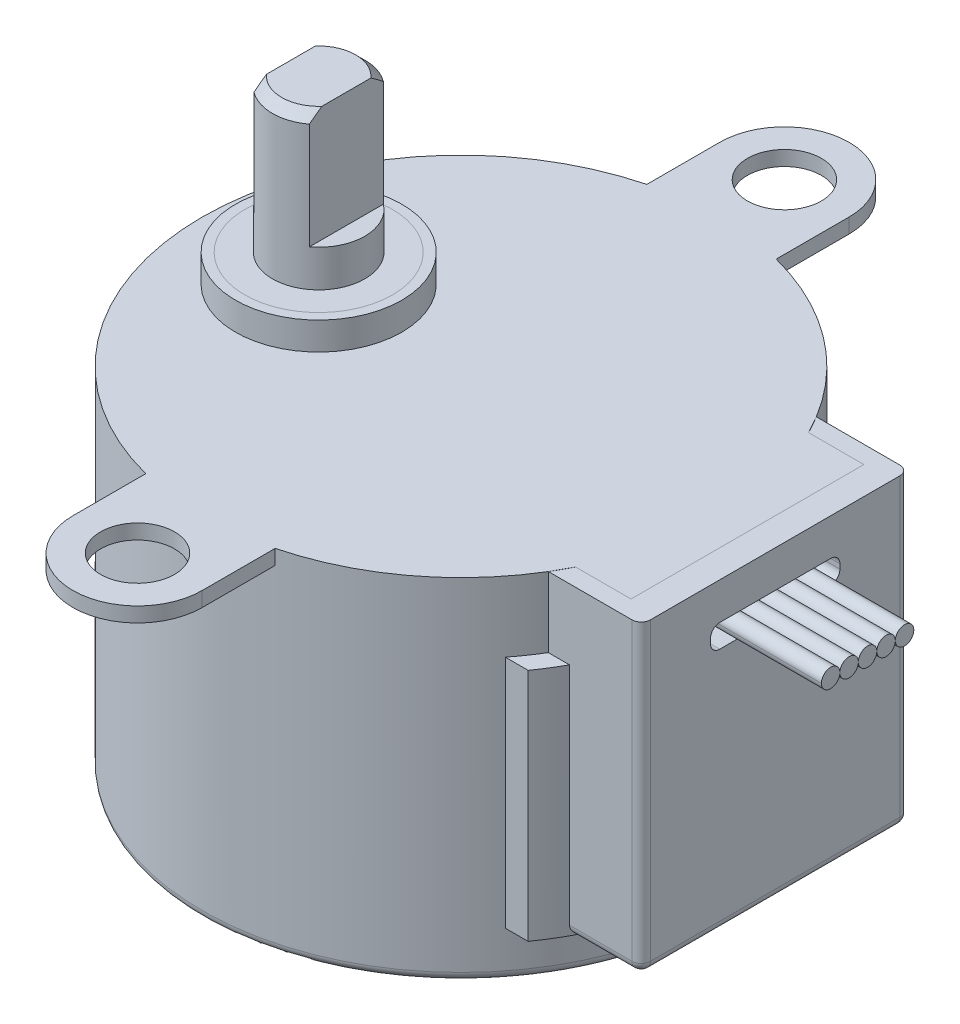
ISO-10303-21;
HEADER;
FILE_DESCRIPTION(('STEP AP214'),'2;1');
FILE_NAME('part.step','',(''),(''),'','','');
FILE_SCHEMA(('AUTOMOTIVE_DESIGN { 1 0 10303 214 1 1 1 1 }'));
ENDSEC;
DATA;
#1=APPLICATION_CONTEXT('core data for automotive mechanical design processes');
#2=APPLICATION_PROTOCOL_DEFINITION('international standard','automotive_design',2000,#1);
#3=PRODUCT_CONTEXT('',#1,'mechanical');
#4=PRODUCT('Part','Part','',(#3));
#5=PRODUCT_RELATED_PRODUCT_CATEGORY('part','',(#4));
#6=PRODUCT_DEFINITION_FORMATION('','',#4);
#7=PRODUCT_DEFINITION_CONTEXT('part definition',#1,'design');
#8=PRODUCT_DEFINITION('design','',#6,#7);
#9=PRODUCT_DEFINITION_SHAPE('','',#8);
#10=(LENGTH_UNIT() NAMED_UNIT(*) SI_UNIT(.MILLI.,.METRE.));
#11=(NAMED_UNIT(*) PLANE_ANGLE_UNIT() SI_UNIT($,.RADIAN.));
#12=(NAMED_UNIT(*) SI_UNIT($,.STERADIAN.) SOLID_ANGLE_UNIT());
#13=UNCERTAINTY_MEASURE_WITH_UNIT(LENGTH_MEASURE(1.E-05),#10,'distance_accuracy_value','');
#14=(GEOMETRIC_REPRESENTATION_CONTEXT(3) GLOBAL_UNCERTAINTY_ASSIGNED_CONTEXT((#13)) GLOBAL_UNIT_ASSIGNED_CONTEXT((#10,
#11,#12)) REPRESENTATION_CONTEXT('',''));
#15=CARTESIAN_POINT('',(0.,0.,0.));
#16=DIRECTION('',(0.,0.,1.));
#17=DIRECTION('',(1.,0.,0.));
#18=AXIS2_PLACEMENT_3D('',#15,#16,#17);
#19=CARTESIAN_POINT('',(0.,19.,0.));
#20=DIRECTION('',(0.,1.,0.));
#21=DIRECTION('',(1.,0.,0.));
#22=AXIS2_PLACEMENT_3D('',#19,#20,#21);
#23=PLANE('',#22);
#24=CARTESIAN_POINT('',(-7.7,19.,0.));
#25=DIRECTION('',(0.,-1.,0.));
#26=DIRECTION('',(-1.,0.,0.));
#27=AXIS2_PLACEMENT_3D('',#24,#25,#26);
#28=CIRCLE('',#27,2.5);
#29=CARTESIAN_POINT('',(-5.2,19.,0.));
#30=VERTEX_POINT('',#29);
#31=EDGE_CURVE('P0_E265',#30,#30,#28,.T.);
#32=ORIENTED_EDGE('',*,*,#31,.T.);
#33=EDGE_LOOP('',(#32));
#34=FACE_BOUND('',#33,.T.);
#35=CARTESIAN_POINT('',(-7.7,19.,0.));
#36=DIRECTION('',(0.,1.,0.));
#37=DIRECTION('',(-1.,0.,0.));
#38=AXIS2_PLACEMENT_3D('',#35,#36,#37);
#39=CIRCLE('',#38,4.);
#40=CARTESIAN_POINT('',(-3.7,19.,0.));
#41=VERTEX_POINT('',#40);
#42=EDGE_CURVE('P0_E802',#41,#41,#39,.T.);
#43=ORIENTED_EDGE('',*,*,#42,.T.);
#44=EDGE_LOOP('',(#43));
#45=FACE_BOUND('',#44,.T.);
#46=ADVANCED_FACE('P0_F16',(#34,#45),#23,.T.);
#47=CARTESIAN_POINT('',(14.0011998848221,9.,0.));
#48=DIRECTION('',(0.,1.,0.));
#49=DIRECTION('',(1.,0.,0.));
#50=AXIS2_PLACEMENT_3D('',#47,#48,#49);
#51=PLANE('',#50);
#52=DIRECTION('',(0.,0.,1.));
#53=VECTOR('',#52,1.);
#54=CARTESIAN_POINT('',(15.5,9.,0.));
#55=LINE('',#54,#53);
#56=CARTESIAN_POINT('',(15.5,9.,-6.3));
#57=VERTEX_POINT('',#56);
#58=CARTESIAN_POINT('',(15.5,9.,6.3));
#59=VERTEX_POINT('',#58);
#60=EDGE_CURVE('P0_E11',#57,#59,#55,.T.);
#61=ORIENTED_EDGE('',*,*,#60,.T.);
#62=DIRECTION('',(-1.,0.,0.));
#63=VECTOR('',#62,1.);
#64=CARTESIAN_POINT('',(15.5,9.,6.3));
#65=LINE('',#64,#63);
#66=CARTESIAN_POINT('',(12.5023997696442,9.,6.3));
#67=VERTEX_POINT('',#66);
#68=EDGE_CURVE('P0_E606',#59,#67,#65,.T.);
#69=ORIENTED_EDGE('',*,*,#68,.T.);
#70=CARTESIAN_POINT('',(0.,9.,0.));
#71=DIRECTION('',(0.,-1.,0.));
#72=DIRECTION('',(1.,0.,0.));
#73=AXIS2_PLACEMENT_3D('',#70,#71,#72);
#74=CIRCLE('',#73,14.);
#75=CARTESIAN_POINT('',(12.5023997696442,9.,-6.3));
#76=VERTEX_POINT('',#75);
#77=EDGE_CURVE('P0_E516',#76,#67,#74,.T.);
#78=ORIENTED_EDGE('',*,*,#77,.F.);
#79=DIRECTION('',(1.,0.,0.));
#80=VECTOR('',#79,1.);
#81=CARTESIAN_POINT('',(15.5,9.,-6.3));
#82=LINE('',#81,#80);
#83=EDGE_CURVE('P0_E242',#76,#57,#82,.T.);
#84=ORIENTED_EDGE('',*,*,#83,.T.);
#85=EDGE_LOOP('',(#61,#69,#78,#84));
#86=FACE_BOUND('',#85,.T.);
#87=ADVANCED_FACE('P0_F327',(#86),#51,.F.);
#88=CARTESIAN_POINT('',(15.5,19.,-6.3));
#89=DIRECTION('',(1.,0.,0.));
#90=DIRECTION('',(0.,1.,0.));
#91=AXIS2_PLACEMENT_3D('',#88,#89,#90);
#92=PLANE('',#91);
#93=DIRECTION('',(0.,0.,-1.));
#94=VECTOR('',#93,1.);
#95=CARTESIAN_POINT('',(15.5,19.,0.));
#96=LINE('',#95,#94);
#97=CARTESIAN_POINT('',(15.5,19.,6.3));
#98=VERTEX_POINT('',#97);
#99=CARTESIAN_POINT('',(15.5,19.,-6.3));
#100=VERTEX_POINT('',#99);
#101=EDGE_CURVE('P0_E222',#98,#100,#96,.T.);
#102=ORIENTED_EDGE('',*,*,#101,.F.);
#103=DIRECTION('',(0.,-1.,0.));
#104=VECTOR('',#103,1.);
#105=CARTESIAN_POINT('',(15.5,19.,6.3));
#106=LINE('',#105,#104);
#107=EDGE_CURVE('P0_E27',#98,#59,#106,.T.);
#108=ORIENTED_EDGE('',*,*,#107,.T.);
#109=ORIENTED_EDGE('',*,*,#60,.F.);
#110=DIRECTION('',(0.,-1.,0.));
#111=VECTOR('',#110,1.);
#112=CARTESIAN_POINT('',(15.5,19.,-6.3));
#113=LINE('',#112,#111);
#114=EDGE_CURVE('P0_E238',#100,#57,#113,.T.);
#115=ORIENTED_EDGE('',*,*,#114,.F.);
#116=EDGE_LOOP('',(#102,#108,#109,#115));
#117=FACE_BOUND('',#116,.T.);
#118=ADVANCED_FACE('P0_F333',(#117),#92,.T.);
#119=CARTESIAN_POINT('',(15.5,19.,6.3));
#120=DIRECTION('',(0.,0.,1.));
#121=DIRECTION('',(1.,0.,0.));
#122=AXIS2_PLACEMENT_3D('',#119,#120,#121);
#123=PLANE('',#122);
#124=DIRECTION('',(-1.,0.,0.));
#125=VECTOR('',#124,1.);
#126=CARTESIAN_POINT('',(15.5,19.,6.3));
#127=LINE('',#126,#125);
#128=CARTESIAN_POINT('',(12.5023997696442,19.,6.3));
#129=VERTEX_POINT('',#128);
#130=EDGE_CURVE('P0_E219',#98,#129,#127,.T.);
#131=ORIENTED_EDGE('',*,*,#130,.T.);
#132=DIRECTION('',(0.,1.,0.));
#133=VECTOR('',#132,1.);
#134=CARTESIAN_POINT('',(12.5023997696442,0.,6.3));
#135=LINE('',#134,#133);
#136=EDGE_CURVE('P0_E305',#67,#129,#135,.T.);
#137=ORIENTED_EDGE('',*,*,#136,.F.);
#138=ORIENTED_EDGE('',*,*,#68,.F.);
#139=ORIENTED_EDGE('',*,*,#107,.F.);
#140=EDGE_LOOP('',(#131,#137,#138,#139));
#141=FACE_BOUND('',#140,.T.);
#142=ADVANCED_FACE('P0_F660',(#141),#123,.T.);
#143=CARTESIAN_POINT('',(12.5023997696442,19.,-6.3));
#144=DIRECTION('',(0.,0.,-1.));
#145=DIRECTION('',(0.,-1.,0.));
#146=AXIS2_PLACEMENT_3D('',#143,#144,#145);
#147=PLANE('',#146);
#148=DIRECTION('',(-1.,0.,0.));
#149=VECTOR('',#148,1.);
#150=CARTESIAN_POINT('',(15.5,19.,-6.3));
#151=LINE('',#150,#149);
#152=CARTESIAN_POINT('',(12.5023997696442,19.,-6.3));
#153=VERTEX_POINT('',#152);
#154=EDGE_CURVE('P0_E243',#100,#153,#151,.T.);
#155=ORIENTED_EDGE('',*,*,#154,.F.);
#156=ORIENTED_EDGE('',*,*,#114,.T.);
#157=ORIENTED_EDGE('',*,*,#83,.F.);
#158=DIRECTION('',(0.,-1.,0.));
#159=VECTOR('',#158,1.);
#160=CARTESIAN_POINT('',(12.5023997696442,0.,-6.3));
#161=LINE('',#160,#159);
#162=EDGE_CURVE('P0_E523',#153,#76,#161,.T.);
#163=ORIENTED_EDGE('',*,*,#162,.F.);
#164=EDGE_LOOP('',(#155,#156,#157,#163));
#165=FACE_BOUND('',#164,.T.);
#166=ADVANCED_FACE('P0_F656',(#165),#147,.T.);
#167=CARTESIAN_POINT('',(0.,19.,0.));
#168=DIRECTION('',(0.,1.,0.));
#169=DIRECTION('',(1.,0.,0.));
#170=AXIS2_PLACEMENT_3D('',#167,#168,#169);
#171=PLANE('',#170);
#172=CARTESIAN_POINT('',(-7.7,19.,0.));
#173=DIRECTION('',(0.,-1.,0.));
#174=DIRECTION('',(-1.,0.,0.));
#175=AXIS2_PLACEMENT_3D('',#172,#173,#174);
#176=CIRCLE('',#175,4.5);
#177=CARTESIAN_POINT('',(-3.2,19.,0.));
#178=VERTEX_POINT('',#177);
#179=EDGE_CURVE('P0_E223',#178,#178,#176,.T.);
#180=ORIENTED_EDGE('',*,*,#179,.T.);
#181=EDGE_LOOP('',(#180));
#182=FACE_BOUND('',#181,.T.);
#183=CARTESIAN_POINT('',(0.,19.,17.5));
#184=DIRECTION('',(0.,-1.,0.));
#185=DIRECTION('',(-1.,0.,0.));
#186=AXIS2_PLACEMENT_3D('',#183,#184,#185);
#187=CIRCLE('',#186,2.);
#188=CARTESIAN_POINT('',(2.,19.,17.5));
#189=VERTEX_POINT('',#188);
#190=EDGE_CURVE('P0_E283',#189,#189,#187,.T.);
#191=ORIENTED_EDGE('',*,*,#190,.T.);
#192=EDGE_LOOP('',(#191));
#193=FACE_BOUND('',#192,.T.);
#194=CARTESIAN_POINT('',(0.,19.,-17.5));
#195=DIRECTION('',(0.,-1.,0.));
#196=DIRECTION('',(-1.,0.,0.));
#197=AXIS2_PLACEMENT_3D('',#194,#195,#196);
#198=CIRCLE('',#197,2.);
#199=CARTESIAN_POINT('',(2.,19.,-17.5));
#200=VERTEX_POINT('',#199);
#201=EDGE_CURVE('P0_E453',#200,#200,#198,.T.);
#202=ORIENTED_EDGE('',*,*,#201,.T.);
#203=EDGE_LOOP('',(#202));
#204=FACE_BOUND('',#203,.T.);
#205=CARTESIAN_POINT('',(0.,19.,0.));
#206=DIRECTION('',(0.,1.,0.));
#207=DIRECTION('',(1.,0.,0.));
#208=AXIS2_PLACEMENT_3D('',#205,#206,#207);
#209=CIRCLE('',#208,14.);
#210=CARTESIAN_POINT('',(3.5,19.,-13.555441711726));
#211=VERTEX_POINT('',#210);
#212=EDGE_CURVE('P0_E231',#153,#211,#209,.T.);
#213=ORIENTED_EDGE('',*,*,#212,.T.);
#214=DIRECTION('',(0.,0.,1.));
#215=VECTOR('',#214,1.);
#216=CARTESIAN_POINT('',(3.5,19.,-17.5));
#217=LINE('',#216,#215);
#218=CARTESIAN_POINT('',(3.5,19.,-17.5));
#219=VERTEX_POINT('',#218);
#220=EDGE_CURVE('P0_E275',#219,#211,#217,.T.);
#221=ORIENTED_EDGE('',*,*,#220,.F.);
#222=CARTESIAN_POINT('',(0.,19.,-17.5));
#223=DIRECTION('',(0.,1.,0.));
#224=DIRECTION('',(1.,0.,0.));
#225=AXIS2_PLACEMENT_3D('',#222,#223,#224);
#226=CIRCLE('',#225,3.5);
#227=CARTESIAN_POINT('',(-3.49999999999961,19.,-17.4999983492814));
#228=VERTEX_POINT('',#227);
#229=EDGE_CURVE('P0_E261',#219,#228,#226,.T.);
#230=ORIENTED_EDGE('',*,*,#229,.T.);
#231=DIRECTION('',(0.,0.,1.));
#232=VECTOR('',#231,1.);
#233=CARTESIAN_POINT('',(-3.49999999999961,19.,-17.4999983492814));
#234=LINE('',#233,#232);
#235=CARTESIAN_POINT('',(-3.49999999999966,19.,-13.5554417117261));
#236=VERTEX_POINT('',#235);
#237=EDGE_CURVE('P0_E447',#228,#236,#234,.T.);
#238=ORIENTED_EDGE('',*,*,#237,.T.);
#239=CARTESIAN_POINT('',(0.,19.,0.));
#240=DIRECTION('',(0.,1.,0.));
#241=DIRECTION('',(1.,0.,0.));
#242=AXIS2_PLACEMENT_3D('',#239,#240,#241);
#243=CIRCLE('',#242,14.);
#244=CARTESIAN_POINT('',(-14.,19.,0.));
#245=VERTEX_POINT('',#244);
#246=EDGE_CURVE('P0_E197',#236,#245,#243,.T.);
#247=ORIENTED_EDGE('',*,*,#246,.T.);
#248=CARTESIAN_POINT('',(0.,19.,0.));
#249=DIRECTION('',(0.,1.,0.));
#250=DIRECTION('',(1.,0.,0.));
#251=AXIS2_PLACEMENT_3D('',#248,#249,#250);
#252=CIRCLE('',#251,14.);
#253=CARTESIAN_POINT('',(-3.49999999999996,19.,13.555441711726));
#254=VERTEX_POINT('',#253);
#255=EDGE_CURVE('P0_E194',#245,#254,#252,.T.);
#256=ORIENTED_EDGE('',*,*,#255,.T.);
#257=DIRECTION('',(0.,0.,1.));
#258=VECTOR('',#257,1.);
#259=CARTESIAN_POINT('',(-3.49999999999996,19.,13.555441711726));
#260=LINE('',#259,#258);
#261=CARTESIAN_POINT('',(-3.5,19.,17.5));
#262=VERTEX_POINT('',#261);
#263=EDGE_CURVE('P0_E292',#254,#262,#260,.T.);
#264=ORIENTED_EDGE('',*,*,#263,.T.);
#265=CARTESIAN_POINT('',(0.,19.,17.5));
#266=DIRECTION('',(0.,1.,0.));
#267=DIRECTION('',(-1.,0.,0.));
#268=AXIS2_PLACEMENT_3D('',#265,#266,#267);
#269=CIRCLE('',#268,3.5);
#270=CARTESIAN_POINT('',(3.5,19.,17.5));
#271=VERTEX_POINT('',#270);
#272=EDGE_CURVE('P0_E252',#262,#271,#269,.T.);
#273=ORIENTED_EDGE('',*,*,#272,.T.);
#274=DIRECTION('',(0.,0.,1.));
#275=VECTOR('',#274,1.);
#276=CARTESIAN_POINT('',(3.5,19.,13.555441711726));
#277=LINE('',#276,#275);
#278=CARTESIAN_POINT('',(3.5,19.,13.555441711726));
#279=VERTEX_POINT('',#278);
#280=EDGE_CURVE('P0_E293',#279,#271,#277,.T.);
#281=ORIENTED_EDGE('',*,*,#280,.F.);
#282=CARTESIAN_POINT('',(0.,19.,0.));
#283=DIRECTION('',(0.,1.,0.));
#284=DIRECTION('',(1.,0.,0.));
#285=AXIS2_PLACEMENT_3D('',#282,#283,#284);
#286=CIRCLE('',#285,14.);
#287=EDGE_CURVE('P0_E301',#279,#129,#286,.T.);
#288=ORIENTED_EDGE('',*,*,#287,.T.);
#289=ORIENTED_EDGE('',*,*,#130,.F.);
#290=ORIENTED_EDGE('',*,*,#101,.T.);
#291=ORIENTED_EDGE('',*,*,#154,.T.);
#292=EDGE_LOOP('',(#213,#221,#230,#238,#247,#256,#264,#273,#281,#288,#289,#290,#291));
#293=FACE_BOUND('',#292,.T.);
#294=ADVANCED_FACE('P0_F625',(#182,#193,#204,#293),#171,.T.);
#295=CARTESIAN_POINT('',(-7.7,20.5,0.));
#296=DIRECTION('',(0.,1.,0.));
#297=DIRECTION('',(1.,0.,0.));
#298=AXIS2_PLACEMENT_3D('',#295,#296,#297);
#299=PLANE('',#298);
#300=CARTESIAN_POINT('',(-7.7,20.5,0.));
#301=DIRECTION('',(0.,-1.,0.));
#302=DIRECTION('',(-1.,0.,0.));
#303=AXIS2_PLACEMENT_3D('',#300,#301,#302);
#304=CIRCLE('',#303,4.);
#305=CARTESIAN_POINT('',(-3.7,20.5,0.));
#306=VERTEX_POINT('',#305);
#307=EDGE_CURVE('P0_E244',#306,#306,#304,.T.);
#308=ORIENTED_EDGE('',*,*,#307,.T.);
#309=EDGE_LOOP('',(#308));
#310=FACE_BOUND('',#309,.T.);
#311=CARTESIAN_POINT('',(-7.7,20.5,0.));
#312=DIRECTION('',(0.,1.,0.));
#313=DIRECTION('',(-1.,0.,0.));
#314=AXIS2_PLACEMENT_3D('',#311,#312,#313);
#315=CIRCLE('',#314,4.5);
#316=CARTESIAN_POINT('',(-3.2,20.5,0.));
#317=VERTEX_POINT('',#316);
#318=EDGE_CURVE('P0_E791',#317,#317,#315,.T.);
#319=ORIENTED_EDGE('',*,*,#318,.T.);
#320=EDGE_LOOP('',(#319));
#321=FACE_BOUND('',#320,.T.);
#322=ADVANCED_FACE('P0_F18',(#310,#321),#299,.T.);
#323=CARTESIAN_POINT('',(-7.7,19.,0.));
#324=DIRECTION('',(0.,1.,0.));
#325=DIRECTION('',(-1.,0.,0.));
#326=AXIS2_PLACEMENT_3D('',#323,#324,#325);
#327=CYLINDRICAL_SURFACE('',#326,4.5);
#328=ORIENTED_EDGE('',*,*,#318,.F.);
#329=DIRECTION('',(0.,-1.,0.));
#330=VECTOR('',#329,1.);
#331=CARTESIAN_POINT('',(-3.2,19.,0.));
#332=LINE('',#331,#330);
#333=EDGE_CURVE('P0_E20',#317,#178,#332,.T.);
#334=ORIENTED_EDGE('',*,*,#333,.T.);
#335=ORIENTED_EDGE('',*,*,#179,.F.);
#336=ORIENTED_EDGE('',*,*,#333,.F.);
#337=EDGE_LOOP('',(#328,#334,#335,#336));
#338=FACE_BOUND('',#337,.T.);
#339=ADVANCED_FACE('P0_F624',(#338),#327,.T.);
#340=CARTESIAN_POINT('',(-7.7,19.,0.));
#341=DIRECTION('',(0.,1.,0.));
#342=DIRECTION('',(-1.,0.,0.));
#343=AXIS2_PLACEMENT_3D('',#340,#341,#342);
#344=CYLINDRICAL_SURFACE('',#343,4.);
#345=ORIENTED_EDGE('',*,*,#307,.F.);
#346=DIRECTION('',(0.,-1.,0.));
#347=VECTOR('',#346,1.);
#348=CARTESIAN_POINT('',(-3.7,19.,0.));
#349=LINE('',#348,#347);
#350=EDGE_CURVE('P0_E248',#306,#41,#349,.T.);
#351=ORIENTED_EDGE('',*,*,#350,.T.);
#352=ORIENTED_EDGE('',*,*,#42,.F.);
#353=ORIENTED_EDGE('',*,*,#350,.F.);
#354=EDGE_LOOP('',(#345,#351,#352,#353));
#355=FACE_BOUND('',#354,.T.);
#356=ADVANCED_FACE('P0_F355',(#355),#344,.F.);
#357=CARTESIAN_POINT('',(-7.7,4.,0.));
#358=DIRECTION('',(0.,1.,0.));
#359=DIRECTION('',(1.,0.,0.));
#360=AXIS2_PLACEMENT_3D('',#357,#358,#359);
#361=PLANE('',#360);
#362=CARTESIAN_POINT('',(-7.7,4.,0.));
#363=DIRECTION('',(0.,-1.,0.));
#364=DIRECTION('',(-1.,0.,0.));
#365=AXIS2_PLACEMENT_3D('',#362,#363,#364);
#366=CIRCLE('',#365,2.5);
#367=CARTESIAN_POINT('',(-5.2,4.,0.));
#368=VERTEX_POINT('',#367);
#369=EDGE_CURVE('P0_E217',#368,#368,#366,.T.);
#370=ORIENTED_EDGE('',*,*,#369,.F.);
#371=EDGE_LOOP('',(#370));
#372=FACE_BOUND('',#371,.T.);
#373=ADVANCED_FACE('P0_F347',(#372),#361,.T.);
#374=CARTESIAN_POINT('',(-7.7,19.,0.));
#375=DIRECTION('',(0.,-1.,0.));
#376=DIRECTION('',(-1.,0.,0.));
#377=AXIS2_PLACEMENT_3D('',#374,#375,#376);
#378=CYLINDRICAL_SURFACE('',#377,2.5);
#379=ORIENTED_EDGE('',*,*,#31,.F.);
#380=DIRECTION('',(0.,-1.,0.));
#381=VECTOR('',#380,1.);
#382=CARTESIAN_POINT('',(-5.2,19.,0.));
#383=LINE('',#382,#381);
#384=EDGE_CURVE('P0_E269',#30,#368,#383,.T.);
#385=ORIENTED_EDGE('',*,*,#384,.T.);
#386=ORIENTED_EDGE('',*,*,#369,.T.);
#387=ORIENTED_EDGE('',*,*,#384,.F.);
#388=EDGE_LOOP('',(#379,#385,#386,#387));
#389=FACE_BOUND('',#388,.T.);
#390=ADVANCED_FACE('P0_F345',(#389),#378,.F.);
#391=CARTESIAN_POINT('',(0.,18.2,17.277720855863));
#392=DIRECTION('',(0.,1.,0.));
#393=DIRECTION('',(1.,0.,0.));
#394=AXIS2_PLACEMENT_3D('',#391,#392,#393);
#395=PLANE('',#394);
#396=CARTESIAN_POINT('',(0.,18.2,17.5));
#397=DIRECTION('',(0.,1.,0.));
#398=DIRECTION('',(-1.,0.,0.));
#399=AXIS2_PLACEMENT_3D('',#396,#397,#398);
#400=CIRCLE('',#399,2.);
#401=CARTESIAN_POINT('',(2.,18.2,17.5));
#402=VERTEX_POINT('',#401);
#403=EDGE_CURVE('P0_E232',#402,#402,#400,.T.);
#404=ORIENTED_EDGE('',*,*,#403,.T.);
#405=EDGE_LOOP('',(#404));
#406=FACE_BOUND('',#405,.T.);
#407=CARTESIAN_POINT('',(0.,18.2,0.));
#408=DIRECTION('',(0.,-1.,0.));
#409=DIRECTION('',(1.,0.,0.));
#410=AXIS2_PLACEMENT_3D('',#407,#408,#409);
#411=CIRCLE('',#410,14.);
#412=CARTESIAN_POINT('',(3.5,18.2,13.555441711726));
#413=VERTEX_POINT('',#412);
#414=CARTESIAN_POINT('',(-3.49999999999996,18.2,13.555441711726));
#415=VERTEX_POINT('',#414);
#416=EDGE_CURVE('P0_E300',#413,#415,#411,.T.);
#417=ORIENTED_EDGE('',*,*,#416,.F.);
#418=DIRECTION('',(0.,0.,1.));
#419=VECTOR('',#418,1.);
#420=CARTESIAN_POINT('',(3.5,18.2,13.555441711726));
#421=LINE('',#420,#419);
#422=CARTESIAN_POINT('',(3.5,18.2,17.5));
#423=VERTEX_POINT('',#422);
#424=EDGE_CURVE('P0_E270',#413,#423,#421,.T.);
#425=ORIENTED_EDGE('',*,*,#424,.T.);
#426=CARTESIAN_POINT('',(0.,18.2,17.5));
#427=DIRECTION('',(0.,-1.,0.));
#428=DIRECTION('',(-1.,0.,0.));
#429=AXIS2_PLACEMENT_3D('',#426,#427,#428);
#430=CIRCLE('',#429,3.5);
#431=CARTESIAN_POINT('',(-3.5,18.2,17.5));
#432=VERTEX_POINT('',#431);
#433=EDGE_CURVE('P0_E256',#423,#432,#430,.T.);
#434=ORIENTED_EDGE('',*,*,#433,.T.);
#435=DIRECTION('',(0.,0.,-1.));
#436=VECTOR('',#435,1.);
#437=CARTESIAN_POINT('',(-3.49999999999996,18.2,13.555441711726));
#438=LINE('',#437,#436);
#439=EDGE_CURVE('P0_E289',#432,#415,#438,.T.);
#440=ORIENTED_EDGE('',*,*,#439,.T.);
#441=EDGE_LOOP('',(#417,#425,#434,#440));
#442=FACE_BOUND('',#441,.T.);
#443=ADVANCED_FACE('P0_F341',(#406,#442),#395,.F.);
#444=CARTESIAN_POINT('',(3.5,19.,13.555441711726));
#445=DIRECTION('',(1.,0.,0.));
#446=DIRECTION('',(0.,0.,-1.));
#447=AXIS2_PLACEMENT_3D('',#444,#445,#446);
#448=PLANE('',#447);
#449=ORIENTED_EDGE('',*,*,#280,.T.);
#450=DIRECTION('',(0.,-1.,0.));
#451=VECTOR('',#450,1.);
#452=CARTESIAN_POINT('',(3.5,19.,17.5));
#453=LINE('',#452,#451);
#454=EDGE_CURVE('P0_E279',#271,#423,#453,.T.);
#455=ORIENTED_EDGE('',*,*,#454,.T.);
#456=ORIENTED_EDGE('',*,*,#424,.F.);
#457=DIRECTION('',(0.,-1.,0.));
#458=VECTOR('',#457,1.);
#459=CARTESIAN_POINT('',(3.5,0.,13.555441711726));
#460=LINE('',#459,#458);
#461=EDGE_CURVE('P0_E296',#279,#413,#460,.T.);
#462=ORIENTED_EDGE('',*,*,#461,.F.);
#463=EDGE_LOOP('',(#449,#455,#456,#462));
#464=FACE_BOUND('',#463,.T.);
#465=ADVANCED_FACE('P0_F337',(#464),#448,.T.);
#466=CARTESIAN_POINT('',(0.,19.,17.5));
#467=DIRECTION('',(0.,-1.,0.));
#468=DIRECTION('',(-1.,0.,0.));
#469=AXIS2_PLACEMENT_3D('',#466,#467,#468);
#470=CYLINDRICAL_SURFACE('',#469,3.5);
#471=ORIENTED_EDGE('',*,*,#272,.F.);
#472=DIRECTION('',(0.,-1.,0.));
#473=VECTOR('',#472,1.);
#474=CARTESIAN_POINT('',(-3.5,19.,17.5));
#475=LINE('',#474,#473);
#476=EDGE_CURVE('P0_E257',#262,#432,#475,.T.);
#477=ORIENTED_EDGE('',*,*,#476,.T.);
#478=ORIENTED_EDGE('',*,*,#433,.F.);
#479=ORIENTED_EDGE('',*,*,#454,.F.);
#480=EDGE_LOOP('',(#471,#477,#478,#479));
#481=FACE_BOUND('',#480,.T.);
#482=ADVANCED_FACE('P0_F340',(#481),#470,.T.);
#483=CARTESIAN_POINT('',(-3.5,19.,17.5));
#484=DIRECTION('',(-1.,0.,0.));
#485=DIRECTION('',(0.,0.,1.));
#486=AXIS2_PLACEMENT_3D('',#483,#484,#485);
#487=PLANE('',#486);
#488=ORIENTED_EDGE('',*,*,#263,.F.);
#489=DIRECTION('',(0.,1.,0.));
#490=VECTOR('',#489,1.);
#491=CARTESIAN_POINT('',(-3.49999999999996,0.,13.555441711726));
#492=LINE('',#491,#490);
#493=EDGE_CURVE('P0_E260',#415,#254,#492,.T.);
#494=ORIENTED_EDGE('',*,*,#493,.F.);
#495=ORIENTED_EDGE('',*,*,#439,.F.);
#496=ORIENTED_EDGE('',*,*,#476,.F.);
#497=EDGE_LOOP('',(#488,#494,#495,#496));
#498=FACE_BOUND('',#497,.T.);
#499=ADVANCED_FACE('P0_F704',(#498),#487,.T.);
#500=CARTESIAN_POINT('',(0.,19.,17.5));
#501=DIRECTION('',(0.,-1.,0.));
#502=DIRECTION('',(-1.,0.,0.));
#503=AXIS2_PLACEMENT_3D('',#500,#501,#502);
#504=CYLINDRICAL_SURFACE('',#503,2.);
#505=ORIENTED_EDGE('',*,*,#403,.F.);
#506=DIRECTION('',(0.,1.,0.));
#507=VECTOR('',#506,1.);
#508=CARTESIAN_POINT('',(2.,19.,17.5));
#509=LINE('',#508,#507);
#510=EDGE_CURVE('P0_E236',#402,#189,#509,.T.);
#511=ORIENTED_EDGE('',*,*,#510,.T.);
#512=ORIENTED_EDGE('',*,*,#190,.F.);
#513=ORIENTED_EDGE('',*,*,#510,.F.);
#514=EDGE_LOOP('',(#505,#511,#512,#513));
#515=FACE_BOUND('',#514,.T.);
#516=ADVANCED_FACE('P0_F700',(#515),#504,.F.);
#517=CARTESIAN_POINT('',(0.,18.2,-17.277720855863));
#518=DIRECTION('',(0.,1.,0.));
#519=DIRECTION('',(1.,0.,0.));
#520=AXIS2_PLACEMENT_3D('',#517,#518,#519);
#521=PLANE('',#520);
#522=CARTESIAN_POINT('',(0.,18.2,-17.5));
#523=DIRECTION('',(0.,1.,0.));
#524=DIRECTION('',(-1.,0.,0.));
#525=AXIS2_PLACEMENT_3D('',#522,#523,#524);
#526=CIRCLE('',#525,2.);
#527=CARTESIAN_POINT('',(2.,18.2,-17.5));
#528=VERTEX_POINT('',#527);
#529=EDGE_CURVE('P0_E466',#528,#528,#526,.T.);
#530=ORIENTED_EDGE('',*,*,#529,.T.);
#531=EDGE_LOOP('',(#530));
#532=FACE_BOUND('',#531,.T.);
#533=CARTESIAN_POINT('',(0.,18.2,-17.5));
#534=DIRECTION('',(0.,-1.,0.));
#535=DIRECTION('',(1.,0.,0.));
#536=AXIS2_PLACEMENT_3D('',#533,#534,#535);
#537=CIRCLE('',#536,3.5);
#538=CARTESIAN_POINT('',(-3.49999999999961,18.2,-17.4999983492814));
#539=VERTEX_POINT('',#538);
#540=CARTESIAN_POINT('',(3.5,18.2,-17.5));
#541=VERTEX_POINT('',#540);
#542=EDGE_CURVE('P0_E237',#539,#541,#537,.T.);
#543=ORIENTED_EDGE('',*,*,#542,.T.);
#544=DIRECTION('',(0.,0.,1.));
#545=VECTOR('',#544,1.);
#546=CARTESIAN_POINT('',(3.5,18.2,-17.5));
#547=LINE('',#546,#545);
#548=CARTESIAN_POINT('',(3.5,18.2,-13.555441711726));
#549=VERTEX_POINT('',#548);
#550=EDGE_CURVE('P0_E307',#541,#549,#547,.T.);
#551=ORIENTED_EDGE('',*,*,#550,.T.);
#552=CARTESIAN_POINT('',(0.,18.2,0.));
#553=DIRECTION('',(0.,-1.,0.));
#554=DIRECTION('',(1.,0.,0.));
#555=AXIS2_PLACEMENT_3D('',#552,#553,#554);
#556=CIRCLE('',#555,14.);
#557=CARTESIAN_POINT('',(-3.49999999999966,18.2,-13.5554417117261));
#558=VERTEX_POINT('',#557);
#559=EDGE_CURVE('P0_E228',#558,#549,#556,.T.);
#560=ORIENTED_EDGE('',*,*,#559,.F.);
#561=DIRECTION('',(0.,0.,-1.));
#562=VECTOR('',#561,1.);
#563=CARTESIAN_POINT('',(-3.49999999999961,18.2,-17.4999983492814));
#564=LINE('',#563,#562);
#565=EDGE_CURVE('P0_E271',#558,#539,#564,.T.);
#566=ORIENTED_EDGE('',*,*,#565,.T.);
#567=EDGE_LOOP('',(#543,#551,#560,#566));
#568=FACE_BOUND('',#567,.T.);
#569=ADVANCED_FACE('P0_F642',(#532,#568),#521,.F.);
#570=CARTESIAN_POINT('',(0.,19.,-17.5));
#571=DIRECTION('',(0.,-1.,0.));
#572=DIRECTION('',(-2.35816950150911E-07,0.,-0.999999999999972));
#573=AXIS2_PLACEMENT_3D('',#570,#571,#572);
#574=CYLINDRICAL_SURFACE('',#573,3.5);
#575=ORIENTED_EDGE('',*,*,#229,.F.);
#576=DIRECTION('',(0.,-1.,0.));
#577=VECTOR('',#576,1.);
#578=CARTESIAN_POINT('',(3.5,19.,-17.5));
#579=LINE('',#578,#577);
#580=EDGE_CURVE('P0_E264',#219,#541,#579,.T.);
#581=ORIENTED_EDGE('',*,*,#580,.T.);
#582=ORIENTED_EDGE('',*,*,#542,.F.);
#583=DIRECTION('',(0.,-1.,0.));
#584=VECTOR('',#583,1.);
#585=CARTESIAN_POINT('',(-3.49999999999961,19.,-17.4999983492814));
#586=LINE('',#585,#584);
#587=EDGE_CURVE('P0_E276',#228,#539,#586,.T.);
#588=ORIENTED_EDGE('',*,*,#587,.F.);
#589=EDGE_LOOP('',(#575,#581,#582,#588));
#590=FACE_BOUND('',#589,.T.);
#591=ADVANCED_FACE('P0_F637',(#590),#574,.T.);
#592=CARTESIAN_POINT('',(3.5,19.,-17.5));
#593=DIRECTION('',(1.,0.,0.));
#594=DIRECTION('',(0.,0.,-1.));
#595=AXIS2_PLACEMENT_3D('',#592,#593,#594);
#596=PLANE('',#595);
#597=ORIENTED_EDGE('',*,*,#220,.T.);
#598=DIRECTION('',(0.,1.,0.));
#599=VECTOR('',#598,1.);
#600=CARTESIAN_POINT('',(3.5,0.,-13.555441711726));
#601=LINE('',#600,#599);
#602=EDGE_CURVE('P0_E206',#549,#211,#601,.T.);
#603=ORIENTED_EDGE('',*,*,#602,.F.);
#604=ORIENTED_EDGE('',*,*,#550,.F.);
#605=ORIENTED_EDGE('',*,*,#580,.F.);
#606=EDGE_LOOP('',(#597,#603,#604,#605));
#607=FACE_BOUND('',#606,.T.);
#608=ADVANCED_FACE('P0_F641',(#607),#596,.T.);
#609=CARTESIAN_POINT('',(-3.49999999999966,19.,-13.5554417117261));
#610=DIRECTION('',(-1.,0.,0.));
#611=DIRECTION('',(0.,0.,1.));
#612=AXIS2_PLACEMENT_3D('',#609,#610,#611);
#613=PLANE('',#612);
#614=ORIENTED_EDGE('',*,*,#237,.F.);
#615=ORIENTED_EDGE('',*,*,#587,.T.);
#616=ORIENTED_EDGE('',*,*,#565,.F.);
#617=DIRECTION('',(0.,-1.,0.));
#618=VECTOR('',#617,1.);
#619=CARTESIAN_POINT('',(-3.49999999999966,0.,-13.555441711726));
#620=LINE('',#619,#618);
#621=EDGE_CURVE('P0_E224',#236,#558,#620,.T.);
#622=ORIENTED_EDGE('',*,*,#621,.F.);
#623=EDGE_LOOP('',(#614,#615,#616,#622));
#624=FACE_BOUND('',#623,.T.);
#625=ADVANCED_FACE('P0_F322',(#624),#613,.T.);
#626=CARTESIAN_POINT('',(0.,19.,-17.5));
#627=DIRECTION('',(0.,-1.,0.));
#628=DIRECTION('',(-1.,0.,0.));
#629=AXIS2_PLACEMENT_3D('',#626,#627,#628);
#630=CYLINDRICAL_SURFACE('',#629,2.);
#631=ORIENTED_EDGE('',*,*,#529,.F.);
#632=DIRECTION('',(0.,1.,0.));
#633=VECTOR('',#632,1.);
#634=CARTESIAN_POINT('',(2.,19.,-17.5));
#635=LINE('',#634,#633);
#636=EDGE_CURVE('P0_E459',#528,#200,#635,.T.);
#637=ORIENTED_EDGE('',*,*,#636,.T.);
#638=ORIENTED_EDGE('',*,*,#201,.F.);
#639=ORIENTED_EDGE('',*,*,#636,.F.);
#640=EDGE_LOOP('',(#631,#637,#638,#639));
#641=FACE_BOUND('',#640,.T.);
#642=ADVANCED_FACE('P0_F314',(#641),#630,.F.);
#643=CARTESIAN_POINT('',(0.,0.,0.));
#644=DIRECTION('',(0.,1.,0.));
#645=DIRECTION('',(1.,0.,0.));
#646=AXIS2_PLACEMENT_3D('',#643,#644,#645);
#647=PLANE('',#646);
#648=CARTESIAN_POINT('',(0.,0.,0.));
#649=DIRECTION('',(0.,1.,0.));
#650=DIRECTION('',(1.,0.,0.));
#651=AXIS2_PLACEMENT_3D('',#648,#649,#650);
#652=CIRCLE('',#651,13.5);
#653=CARTESIAN_POINT('',(0.,0.,-13.5));
#654=VERTEX_POINT('',#653);
#655=EDGE_CURVE('P0_E207',#654,#654,#652,.T.);
#656=ORIENTED_EDGE('',*,*,#655,.F.);
#657=EDGE_LOOP('',(#656));
#658=FACE_BOUND('',#657,.T.);
#659=ADVANCED_FACE('P0_F312',(#658),#647,.F.);
#660=CARTESIAN_POINT('',(0.,0.,0.));
#661=DIRECTION('',(0.,1.,0.));
#662=DIRECTION('',(1.,0.,0.));
#663=AXIS2_PLACEMENT_3D('',#660,#661,#662);
#664=CYLINDRICAL_SURFACE('',#663,14.);
#665=ORIENTED_EDGE('',*,*,#602,.T.);
#666=ORIENTED_EDGE('',*,*,#212,.F.);
#667=ORIENTED_EDGE('',*,*,#162,.T.);
#668=ORIENTED_EDGE('',*,*,#77,.T.);
#669=ORIENTED_EDGE('',*,*,#136,.T.);
#670=ORIENTED_EDGE('',*,*,#287,.F.);
#671=ORIENTED_EDGE('',*,*,#461,.T.);
#672=ORIENTED_EDGE('',*,*,#416,.T.);
#673=ORIENTED_EDGE('',*,*,#493,.T.);
#674=ORIENTED_EDGE('',*,*,#255,.F.);
#675=DIRECTION('',(0.,-1.,0.));
#676=VECTOR('',#675,1.);
#677=CARTESIAN_POINT('',(-14.,0.,0.));
#678=LINE('',#677,#676);
#679=CARTESIAN_POINT('',(-14.,0.5,0.));
#680=VERTEX_POINT('',#679);
#681=EDGE_CURVE('P0_E185',#245,#680,#678,.T.);
#682=ORIENTED_EDGE('',*,*,#681,.T.);
#683=CARTESIAN_POINT('',(0.,0.5,0.));
#684=DIRECTION('',(0.,-1.,0.));
#685=DIRECTION('',(1.,0.,0.));
#686=AXIS2_PLACEMENT_3D('',#683,#684,#685);
#687=CIRCLE('',#686,14.);
#688=CARTESIAN_POINT('',(0.,0.5,-14.));
#689=VERTEX_POINT('',#688);
#690=EDGE_CURVE('P0_E190',#689,#680,#687,.T.);
#691=ORIENTED_EDGE('',*,*,#690,.F.);
#692=CARTESIAN_POINT('',(0.,0.5,0.));
#693=DIRECTION('',(0.,-1.,0.));
#694=DIRECTION('',(1.,0.,0.));
#695=AXIS2_PLACEMENT_3D('',#692,#693,#694);
#696=CIRCLE('',#695,14.);
#697=EDGE_CURVE('P0_E203',#680,#689,#696,.T.);
#698=ORIENTED_EDGE('',*,*,#697,.F.);
#699=ORIENTED_EDGE('',*,*,#681,.F.);
#700=ORIENTED_EDGE('',*,*,#246,.F.);
#701=ORIENTED_EDGE('',*,*,#621,.T.);
#702=ORIENTED_EDGE('',*,*,#559,.T.);
#703=EDGE_LOOP('',(#665,#666,#667,#668,#669,#670,#671,#672,#673,#674,#682,#691,#698,#699,#700,
#701,#702));
#704=FACE_BOUND('',#703,.T.);
#705=ADVANCED_FACE('P0_F188',(#704),#664,.T.);
#706=CARTESIAN_POINT('',(0.,0.5,0.));
#707=DIRECTION('',(0.,1.,0.));
#708=DIRECTION('',(0.,0.,1.));
#709=AXIS2_PLACEMENT_3D('',#706,#707,#708);
#710=TOROIDAL_SURFACE('',#709,13.5,0.5);
#711=ORIENTED_EDGE('',*,*,#697,.T.);
#712=CARTESIAN_POINT('',(0.,0.5,-13.5));
#713=DIRECTION('',(-1.,0.,0.));
#714=DIRECTION('',(0.,0.,-1.));
#715=AXIS2_PLACEMENT_3D('',#712,#713,#714);
#716=CIRCLE('',#715,0.5);
#717=EDGE_CURVE('P0_E204',#689,#654,#716,.T.);
#718=ORIENTED_EDGE('',*,*,#717,.T.);
#719=ORIENTED_EDGE('',*,*,#655,.T.);
#720=ORIENTED_EDGE('',*,*,#717,.F.);
#721=ORIENTED_EDGE('',*,*,#690,.T.);
#722=EDGE_LOOP('',(#711,#718,#719,#720,#721));
#723=FACE_BOUND('',#722,.T.);
#724=ADVANCED_FACE('P0_F201',(#723),#710,.T.);
#725=CLOSED_SHELL('',(#46,#87,#118,#142,#166,#294,#322,#339,#356,#373,#390,#443,#465,#482,#499,
#516,#569,#591,#608,#625,#642,#659,#705,#724));
#726=MANIFOLD_SOLID_BREP('P0_B1',#725);
#727=CARTESIAN_POINT('',(-7.7,19.,0.));
#728=DIRECTION('',(0.,1.,0.));
#729=DIRECTION('',(1.,0.,0.));
#730=AXIS2_PLACEMENT_3D('',#727,#728,#729);
#731=PLANE('',#730);
#732=CARTESIAN_POINT('',(-7.7,19.,0.));
#733=DIRECTION('',(0.,-1.,0.));
#734=DIRECTION('',(-1.,0.,0.));
#735=AXIS2_PLACEMENT_3D('',#732,#733,#734);
#736=CIRCLE('',#735,2.5);
#737=CARTESIAN_POINT('',(-5.2,19.,0.));
#738=VERTEX_POINT('',#737);
#739=EDGE_CURVE('P1_E58',#738,#738,#736,.T.);
#740=ORIENTED_EDGE('',*,*,#739,.F.);
#741=EDGE_LOOP('',(#740));
#742=FACE_BOUND('',#741,.T.);
#743=CARTESIAN_POINT('',(-7.7,19.,0.));
#744=DIRECTION('',(0.,1.,0.));
#745=DIRECTION('',(-1.,0.,0.));
#746=AXIS2_PLACEMENT_3D('',#743,#744,#745);
#747=CIRCLE('',#746,4.);
#748=CARTESIAN_POINT('',(-3.7,19.,0.));
#749=VERTEX_POINT('',#748);
#750=EDGE_CURVE('P1_E11',#749,#749,#747,.T.);
#751=ORIENTED_EDGE('',*,*,#750,.F.);
#752=EDGE_LOOP('',(#751));
#753=FACE_BOUND('',#752,.T.);
#754=ADVANCED_FACE('P1_F16',(#742,#753),#731,.F.);
#755=CARTESIAN_POINT('',(-7.7,20.5,0.));
#756=DIRECTION('',(0.,1.,0.));
#757=DIRECTION('',(1.,0.,0.));
#758=AXIS2_PLACEMENT_3D('',#755,#756,#757);
#759=PLANE('',#758);
#760=CARTESIAN_POINT('',(-7.7,20.5,0.));
#761=DIRECTION('',(0.,-1.,0.));
#762=DIRECTION('',(-1.,0.,0.));
#763=AXIS2_PLACEMENT_3D('',#760,#761,#762);
#764=CIRCLE('',#763,2.5);
#765=CARTESIAN_POINT('',(-5.2,20.5,0.));
#766=VERTEX_POINT('',#765);
#767=EDGE_CURVE('P1_E56',#766,#766,#764,.T.);
#768=ORIENTED_EDGE('',*,*,#767,.T.);
#769=EDGE_LOOP('',(#768));
#770=FACE_BOUND('',#769,.T.);
#771=CARTESIAN_POINT('',(-7.7,20.5,0.));
#772=DIRECTION('',(0.,1.,0.));
#773=DIRECTION('',(-1.,0.,0.));
#774=AXIS2_PLACEMENT_3D('',#771,#772,#773);
#775=CIRCLE('',#774,4.);
#776=CARTESIAN_POINT('',(-3.7,20.5,0.));
#777=VERTEX_POINT('',#776);
#778=EDGE_CURVE('P1_E20',#777,#777,#775,.T.);
#779=ORIENTED_EDGE('',*,*,#778,.T.);
#780=EDGE_LOOP('',(#779));
#781=FACE_BOUND('',#780,.T.);
#782=ADVANCED_FACE('P1_F61',(#770,#781),#759,.T.);
#783=CARTESIAN_POINT('',(-7.7,19.,0.));
#784=DIRECTION('',(0.,1.,0.));
#785=DIRECTION('',(-1.,0.,0.));
#786=AXIS2_PLACEMENT_3D('',#783,#784,#785);
#787=CYLINDRICAL_SURFACE('',#786,4.);
#788=ORIENTED_EDGE('',*,*,#778,.F.);
#789=DIRECTION('',(0.,-1.,0.));
#790=VECTOR('',#789,1.);
#791=CARTESIAN_POINT('',(-3.7,19.,0.));
#792=LINE('',#791,#790);
#793=EDGE_CURVE('P1_E26',#777,#749,#792,.T.);
#794=ORIENTED_EDGE('',*,*,#793,.T.);
#795=ORIENTED_EDGE('',*,*,#750,.T.);
#796=ORIENTED_EDGE('',*,*,#793,.F.);
#797=EDGE_LOOP('',(#788,#794,#795,#796));
#798=FACE_BOUND('',#797,.T.);
#799=ADVANCED_FACE('P1_F77',(#798),#787,.T.);
#800=CARTESIAN_POINT('',(-7.7,19.,0.));
#801=DIRECTION('',(0.,1.,0.));
#802=DIRECTION('',(-1.,0.,0.));
#803=AXIS2_PLACEMENT_3D('',#800,#801,#802);
#804=CYLINDRICAL_SURFACE('',#803,2.5);
#805=ORIENTED_EDGE('',*,*,#767,.F.);
#806=DIRECTION('',(0.,-1.,0.));
#807=VECTOR('',#806,1.);
#808=CARTESIAN_POINT('',(-5.2,19.,0.));
#809=LINE('',#808,#807);
#810=EDGE_CURVE('P1_E54',#766,#738,#809,.T.);
#811=ORIENTED_EDGE('',*,*,#810,.T.);
#812=ORIENTED_EDGE('',*,*,#739,.T.);
#813=ORIENTED_EDGE('',*,*,#810,.F.);
#814=EDGE_LOOP('',(#805,#811,#812,#813));
#815=FACE_BOUND('',#814,.T.);
#816=ADVANCED_FACE('P1_F18',(#815),#804,.F.);
#817=CLOSED_SHELL('',(#754,#782,#799,#816));
#818=MANIFOLD_SOLID_BREP('P1_B1',#817);
#819=CARTESIAN_POINT('',(-7.7,4.,0.));
#820=DIRECTION('',(0.,1.,0.));
#821=DIRECTION('',(1.,0.,0.));
#822=AXIS2_PLACEMENT_3D('',#819,#820,#821);
#823=PLANE('',#822);
#824=CARTESIAN_POINT('',(-7.7,4.,0.));
#825=DIRECTION('',(0.,-1.,0.));
#826=DIRECTION('',(-1.,0.,0.));
#827=AXIS2_PLACEMENT_3D('',#824,#825,#826);
#828=CIRCLE('',#827,2.5);
#829=CARTESIAN_POINT('',(-5.2,4.,0.));
#830=VERTEX_POINT('',#829);
#831=EDGE_CURVE('P2_E11',#830,#830,#828,.T.);
#832=ORIENTED_EDGE('',*,*,#831,.T.);
#833=EDGE_LOOP('',(#832));
#834=FACE_BOUND('',#833,.T.);
#835=ADVANCED_FACE('P2_F16',(#834),#823,.F.);
#836=CARTESIAN_POINT('',(-7.7,4.,0.));
#837=DIRECTION('',(0.,1.,0.));
#838=DIRECTION('',(-1.,0.,0.));
#839=AXIS2_PLACEMENT_3D('',#836,#837,#838);
#840=CYLINDRICAL_SURFACE('',#839,2.5);
#841=CARTESIAN_POINT('',(-7.7,28.25,0.));
#842=DIRECTION('',(0.,1.,0.));
#843=DIRECTION('',(-1.,0.,0.));
#844=AXIS2_PLACEMENT_3D('',#841,#842,#843);
#845=CIRCLE('',#844,2.5);
#846=CARTESIAN_POINT('',(-6.2,28.25,-2.));
#847=VERTEX_POINT('',#846);
#848=CARTESIAN_POINT('',(-9.2,28.25,-2.));
#849=VERTEX_POINT('',#848);
#850=EDGE_CURVE('P2_E134',#847,#849,#845,.T.);
#851=ORIENTED_EDGE('',*,*,#850,.F.);
#852=DIRECTION('',(0.,-1.,0.));
#853=VECTOR('',#852,1.);
#854=CARTESIAN_POINT('',(-6.2,4.,-2.));
#855=LINE('',#854,#853);
#856=CARTESIAN_POINT('',(-6.2,22.5,-2.00000002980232));
#857=VERTEX_POINT('',#856);
#858=EDGE_CURVE('P2_E57',#847,#857,#855,.T.);
#859=ORIENTED_EDGE('',*,*,#858,.T.);
#860=CARTESIAN_POINT('',(-7.7,22.5,0.));
#861=DIRECTION('',(0.,-1.,0.));
#862=DIRECTION('',(-1.,0.,0.));
#863=AXIS2_PLACEMENT_3D('',#860,#861,#862);
#864=CIRCLE('',#863,2.5);
#865=CARTESIAN_POINT('',(-5.2,22.5,0.));
#866=VERTEX_POINT('',#865);
#867=EDGE_CURVE('P2_E190',#857,#866,#864,.T.);
#868=ORIENTED_EDGE('',*,*,#867,.T.);
#869=DIRECTION('',(0.,-1.,0.));
#870=VECTOR('',#869,1.);
#871=CARTESIAN_POINT('',(-5.2,4.,0.));
#872=LINE('',#871,#870);
#873=EDGE_CURVE('P2_E29',#866,#830,#872,.T.);
#874=ORIENTED_EDGE('',*,*,#873,.T.);
#875=ORIENTED_EDGE('',*,*,#831,.F.);
#876=ORIENTED_EDGE('',*,*,#873,.F.);
#877=CARTESIAN_POINT('',(-7.7,22.5,0.));
#878=DIRECTION('',(0.,-1.,0.));
#879=DIRECTION('',(-1.,0.,0.));
#880=AXIS2_PLACEMENT_3D('',#877,#878,#879);
#881=CIRCLE('',#880,2.5);
#882=CARTESIAN_POINT('',(-6.2,22.5,2.00000002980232));
#883=VERTEX_POINT('',#882);
#884=EDGE_CURVE('P2_E115',#866,#883,#881,.T.);
#885=ORIENTED_EDGE('',*,*,#884,.T.);
#886=DIRECTION('',(0.,1.,0.));
#887=VECTOR('',#886,1.);
#888=CARTESIAN_POINT('',(-6.2,4.,2.));
#889=LINE('',#888,#887);
#890=CARTESIAN_POINT('',(-6.2,28.25,2.));
#891=VERTEX_POINT('',#890);
#892=EDGE_CURVE('P2_E144',#883,#891,#889,.T.);
#893=ORIENTED_EDGE('',*,*,#892,.T.);
#894=CARTESIAN_POINT('',(-7.7,28.25,0.));
#895=DIRECTION('',(0.,1.,0.));
#896=DIRECTION('',(-1.,0.,0.));
#897=AXIS2_PLACEMENT_3D('',#894,#895,#896);
#898=CIRCLE('',#897,2.5);
#899=CARTESIAN_POINT('',(-9.2,28.25,2.));
#900=VERTEX_POINT('',#899);
#901=EDGE_CURVE('P2_E125',#900,#891,#898,.T.);
#902=ORIENTED_EDGE('',*,*,#901,.F.);
#903=DIRECTION('',(0.,-1.,0.));
#904=VECTOR('',#903,1.);
#905=CARTESIAN_POINT('',(-9.2,4.,2.));
#906=LINE('',#905,#904);
#907=CARTESIAN_POINT('',(-9.2,22.5,2.00000002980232));
#908=VERTEX_POINT('',#907);
#909=EDGE_CURVE('P2_E101',#900,#908,#906,.T.);
#910=ORIENTED_EDGE('',*,*,#909,.T.);
#911=CARTESIAN_POINT('',(-7.7,22.5,0.));
#912=DIRECTION('',(0.,-1.,0.));
#913=DIRECTION('',(-1.,0.,0.));
#914=AXIS2_PLACEMENT_3D('',#911,#912,#913);
#915=CIRCLE('',#914,2.5);
#916=CARTESIAN_POINT('',(-9.2,22.5,-2.00000002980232));
#917=VERTEX_POINT('',#916);
#918=EDGE_CURVE('P2_E107',#908,#917,#915,.T.);
#919=ORIENTED_EDGE('',*,*,#918,.T.);
#920=DIRECTION('',(0.,1.,0.));
#921=VECTOR('',#920,1.);
#922=CARTESIAN_POINT('',(-9.2,4.,-2.));
#923=LINE('',#922,#921);
#924=EDGE_CURVE('P2_E111',#917,#849,#923,.T.);
#925=ORIENTED_EDGE('',*,*,#924,.T.);
#926=EDGE_LOOP('',(#851,#859,#868,#874,#875,#876,#885,#893,#902,#910,#919,#925));
#927=FACE_BOUND('',#926,.T.);
#928=ADVANCED_FACE('P2_F109',(#927),#840,.T.);
#929=CARTESIAN_POINT('',(-5.7,22.5,0.));
#930=DIRECTION('',(0.,1.,0.));
#931=DIRECTION('',(1.,0.,0.));
#932=AXIS2_PLACEMENT_3D('',#929,#930,#931);
#933=PLANE('',#932);
#934=DIRECTION('',(0.,0.,-1.));
#935=VECTOR('',#934,1.);
#936=CARTESIAN_POINT('',(-6.2,22.5,0.));
#937=LINE('',#936,#935);
#938=EDGE_CURVE('P2_E151',#883,#857,#937,.T.);
#939=ORIENTED_EDGE('',*,*,#938,.F.);
#940=ORIENTED_EDGE('',*,*,#884,.F.);
#941=ORIENTED_EDGE('',*,*,#867,.F.);
#942=EDGE_LOOP('',(#939,#940,#941));
#943=FACE_BOUND('',#942,.T.);
#944=ADVANCED_FACE('P2_F214',(#943),#933,.T.);
#945=CARTESIAN_POINT('',(-9.7,22.5,0.));
#946=DIRECTION('',(0.,1.,0.));
#947=DIRECTION('',(1.,0.,0.));
#948=AXIS2_PLACEMENT_3D('',#945,#946,#947);
#949=PLANE('',#948);
#950=ORIENTED_EDGE('',*,*,#918,.F.);
#951=DIRECTION('',(0.,0.,1.));
#952=VECTOR('',#951,1.);
#953=CARTESIAN_POINT('',(-9.2,22.5,0.));
#954=LINE('',#953,#952);
#955=EDGE_CURVE('P2_E117',#917,#908,#954,.T.);
#956=ORIENTED_EDGE('',*,*,#955,.F.);
#957=EDGE_LOOP('',(#950,#956));
#958=FACE_BOUND('',#957,.T.);
#959=ADVANCED_FACE('P2_F118',(#958),#949,.T.);
#960=CARTESIAN_POINT('',(-9.2,28.75,-2.00000002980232));
#961=DIRECTION('',(1.,0.,0.));
#962=DIRECTION('',(0.,1.,0.));
#963=AXIS2_PLACEMENT_3D('',#960,#961,#962);
#964=PLANE('',#963);
#965=CARTESIAN_POINT('',(-9.19999999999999,28.25,-2.));
#966=CARTESIAN_POINT('',(-9.2,28.5509441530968,-1.62381980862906));
#967=CARTESIAN_POINT('',(-9.2,28.75,-1.32287565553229));
#968=(BOUNDED_CURVE() B_SPLINE_CURVE(2,(#965,#966,#967),.UNSPECIFIED.,.F.,
.F.) B_SPLINE_CURVE_WITH_KNOTS((3,3),(0.756725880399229,0.92335569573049),
.UNSPECIFIED.) CURVE() GEOMETRIC_REPRESENTATION_ITEM() RATIONAL_B_SPLINE_CURVE((1.09904457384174,
1.0604270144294,1.)) REPRESENTATION_ITEM(''));
#969=CARTESIAN_POINT('',(-9.2,28.75,-1.3228756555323));
#970=VERTEX_POINT('',#969);
#971=EDGE_CURVE('P2_E123',#849,#970,#968,.T.);
#972=ORIENTED_EDGE('',*,*,#971,.F.);
#973=ORIENTED_EDGE('',*,*,#924,.F.);
#974=ORIENTED_EDGE('',*,*,#955,.T.);
#975=ORIENTED_EDGE('',*,*,#909,.F.);
#976=CARTESIAN_POINT('',(-9.2,28.75,1.32287565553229));
#977=CARTESIAN_POINT('',(-9.2,28.5509441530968,1.62381980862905));
#978=CARTESIAN_POINT('',(-9.19999999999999,28.25,2.));
#979=(BOUNDED_CURVE() B_SPLINE_CURVE(2,(#976,#977,#978),.UNSPECIFIED.,.F.,
.F.) B_SPLINE_CURVE_WITH_KNOTS((3,3),(0.,0.166629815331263),
.UNSPECIFIED.) CURVE() GEOMETRIC_REPRESENTATION_ITEM() RATIONAL_B_SPLINE_CURVE((1.,
1.0604270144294,1.09904457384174)) REPRESENTATION_ITEM(''));
#980=CARTESIAN_POINT('',(-9.2,28.75,1.3228756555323));
#981=VERTEX_POINT('',#980);
#982=EDGE_CURVE('P2_E20',#981,#900,#979,.T.);
#983=ORIENTED_EDGE('',*,*,#982,.F.);
#984=DIRECTION('',(0.,0.,1.));
#985=VECTOR('',#984,1.);
#986=CARTESIAN_POINT('',(-9.2,28.75,-1.00000001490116));
#987=LINE('',#986,#985);
#988=EDGE_CURVE('P2_E164',#970,#981,#987,.T.);
#989=ORIENTED_EDGE('',*,*,#988,.F.);
#990=EDGE_LOOP('',(#972,#973,#974,#975,#983,#989));
#991=FACE_BOUND('',#990,.T.);
#992=ADVANCED_FACE('P2_F18',(#991),#964,.F.);
#993=CARTESIAN_POINT('',(-7.7,28.5,0.));
#994=DIRECTION('',(0.,-1.,0.));
#995=DIRECTION('',(-1.,0.,0.));
#996=AXIS2_PLACEMENT_3D('',#993,#994,#995);
#997=CONICAL_SURFACE('',#996,2.25,0.78539816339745);
#998=CARTESIAN_POINT('',(-6.2,28.25,2.));
#999=CARTESIAN_POINT('',(-6.2,28.5509441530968,1.62381980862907));
#1000=CARTESIAN_POINT('',(-6.2,28.75,1.32287565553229));
#1001=(BOUNDED_CURVE() B_SPLINE_CURVE(2,(#998,#999,#1000),.UNSPECIFIED.,.F.,
.F.) B_SPLINE_CURVE_WITH_KNOTS((3,3),(0.756725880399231,0.92335569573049),
.UNSPECIFIED.) CURVE() GEOMETRIC_REPRESENTATION_ITEM() RATIONAL_B_SPLINE_CURVE((1.09904457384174,
1.0604270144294,1.)) REPRESENTATION_ITEM(''));
#1002=CARTESIAN_POINT('',(-6.2,28.75,1.3228756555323));
#1003=VERTEX_POINT('',#1002);
#1004=EDGE_CURVE('P2_E137',#891,#1003,#1001,.T.);
#1005=ORIENTED_EDGE('',*,*,#1004,.T.);
#1006=CARTESIAN_POINT('',(-7.7,28.75,0.));
#1007=DIRECTION('',(0.,-1.,0.));
#1008=DIRECTION('',(-1.,0.,0.));
#1009=AXIS2_PLACEMENT_3D('',#1006,#1007,#1008);
#1010=CIRCLE('',#1009,2.);
#1011=EDGE_CURVE('P2_E167',#1003,#981,#1010,.T.);
#1012=ORIENTED_EDGE('',*,*,#1011,.T.);
#1013=ORIENTED_EDGE('',*,*,#982,.T.);
#1014=ORIENTED_EDGE('',*,*,#901,.T.);
#1015=EDGE_LOOP('',(#1005,#1012,#1013,#1014));
#1016=FACE_BOUND('',#1015,.T.);
#1017=ADVANCED_FACE('P2_F177',(#1016),#997,.T.);
#1018=CARTESIAN_POINT('',(-7.7,28.75,0.));
#1019=DIRECTION('',(0.,1.,0.));
#1020=DIRECTION('',(1.,0.,0.));
#1021=AXIS2_PLACEMENT_3D('',#1018,#1019,#1020);
#1022=PLANE('',#1021);
#1023=CARTESIAN_POINT('',(-7.7,28.75,0.));
#1024=DIRECTION('',(0.,-1.,0.));
#1025=DIRECTION('',(-1.,0.,0.));
#1026=AXIS2_PLACEMENT_3D('',#1023,#1024,#1025);
#1027=CIRCLE('',#1026,2.);
#1028=CARTESIAN_POINT('',(-6.2,28.75,-1.3228756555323));
#1029=VERTEX_POINT('',#1028);
#1030=EDGE_CURVE('P2_E158',#970,#1029,#1027,.T.);
#1031=ORIENTED_EDGE('',*,*,#1030,.F.);
#1032=ORIENTED_EDGE('',*,*,#988,.T.);
#1033=ORIENTED_EDGE('',*,*,#1011,.F.);
#1034=DIRECTION('',(0.,0.,-1.));
#1035=VECTOR('',#1034,1.);
#1036=CARTESIAN_POINT('',(-6.2,28.75,1.00000001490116));
#1037=LINE('',#1036,#1035);
#1038=EDGE_CURVE('P2_E71',#1003,#1029,#1037,.T.);
#1039=ORIENTED_EDGE('',*,*,#1038,.T.);
#1040=EDGE_LOOP('',(#1031,#1032,#1033,#1039));
#1041=FACE_BOUND('',#1040,.T.);
#1042=ADVANCED_FACE('P2_F179',(#1041),#1022,.T.);
#1043=CARTESIAN_POINT('',(-6.2,28.75,2.00000002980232));
#1044=DIRECTION('',(-1.,0.,0.));
#1045=DIRECTION('',(0.,0.,1.));
#1046=AXIS2_PLACEMENT_3D('',#1043,#1044,#1045);
#1047=PLANE('',#1046);
#1048=CARTESIAN_POINT('',(-6.2,28.75,-1.32287565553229));
#1049=CARTESIAN_POINT('',(-6.2,28.5509441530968,-1.62381980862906));
#1050=CARTESIAN_POINT('',(-6.2,28.25,-2.));
#1051=(BOUNDED_CURVE() B_SPLINE_CURVE(2,(#1048,#1049,#1050),.UNSPECIFIED.,.F.,
.F.) B_SPLINE_CURVE_WITH_KNOTS((3,3),(0.,0.166629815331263),
.UNSPECIFIED.) CURVE() GEOMETRIC_REPRESENTATION_ITEM() RATIONAL_B_SPLINE_CURVE((1.,
1.0604270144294,1.09904457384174)) REPRESENTATION_ITEM(''));
#1052=EDGE_CURVE('P2_E152',#1029,#847,#1051,.T.);
#1053=ORIENTED_EDGE('',*,*,#1052,.F.);
#1054=ORIENTED_EDGE('',*,*,#1038,.F.);
#1055=ORIENTED_EDGE('',*,*,#1004,.F.);
#1056=ORIENTED_EDGE('',*,*,#892,.F.);
#1057=ORIENTED_EDGE('',*,*,#938,.T.);
#1058=ORIENTED_EDGE('',*,*,#858,.F.);
#1059=EDGE_LOOP('',(#1053,#1054,#1055,#1056,#1057,#1058));
#1060=FACE_BOUND('',#1059,.T.);
#1061=ADVANCED_FACE('P2_F209',(#1060),#1047,.F.);
#1062=CARTESIAN_POINT('',(-7.7,28.5,0.));
#1063=DIRECTION('',(0.,-1.,0.));
#1064=DIRECTION('',(-1.,0.,0.));
#1065=AXIS2_PLACEMENT_3D('',#1062,#1063,#1064);
#1066=CONICAL_SURFACE('',#1065,2.25,0.78539816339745);
#1067=ORIENTED_EDGE('',*,*,#971,.T.);
#1068=ORIENTED_EDGE('',*,*,#1030,.T.);
#1069=ORIENTED_EDGE('',*,*,#1052,.T.);
#1070=ORIENTED_EDGE('',*,*,#850,.T.);
#1071=EDGE_LOOP('',(#1067,#1068,#1069,#1070));
#1072=FACE_BOUND('',#1071,.T.);
#1073=ADVANCED_FACE('P2_F183',(#1072),#1066,.T.);
#1074=CLOSED_SHELL('',(#835,#928,#944,#959,#992,#1017,#1042,#1061,#1073));
#1075=MANIFOLD_SOLID_BREP('P2_B1',#1074);
#1076=CARTESIAN_POINT('',(15.5,19.,6.3));
#1077=DIRECTION('',(-1.,0.,0.));
#1078=DIRECTION('',(0.,0.,1.));
#1079=AXIS2_PLACEMENT_3D('',#1076,#1077,#1078);
#1080=PLANE('',#1079);
#1081=DIRECTION('',(0.,0.,-1.));
#1082=VECTOR('',#1081,1.);
#1083=CARTESIAN_POINT('',(15.5,15.75,1.4));
#1084=LINE('',#1083,#1082);
#1085=CARTESIAN_POINT('',(15.5,15.75,3.));
#1086=VERTEX_POINT('',#1085);
#1087=CARTESIAN_POINT('',(15.5,15.75,-3.));
#1088=VERTEX_POINT('',#1087);
#1089=EDGE_CURVE('P3_E132',#1086,#1088,#1084,.T.);
#1090=ORIENTED_EDGE('',*,*,#1089,.T.);
#1091=CARTESIAN_POINT('',(15.5,16.25,-3.));
#1092=DIRECTION('',(-1.,0.,0.));
#1093=DIRECTION('',(0.,-0.707106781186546,-0.707106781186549));
#1094=AXIS2_PLACEMENT_3D('',#1091,#1092,#1093);
#1095=CIRCLE('',#1094,0.5);
#1096=CARTESIAN_POINT('',(15.5,16.25,-3.5));
#1097=VERTEX_POINT('',#1096);
#1098=EDGE_CURVE('P3_E342',#1097,#1088,#1095,.T.);
#1099=ORIENTED_EDGE('',*,*,#1098,.F.);
#1100=DIRECTION('',(0.,1.,0.));
#1101=VECTOR('',#1100,1.);
#1102=CARTESIAN_POINT('',(15.5,18.,-3.5));
#1103=LINE('',#1102,#1101);
#1104=CARTESIAN_POINT('',(15.5,16.5,-3.5));
#1105=VERTEX_POINT('',#1104);
#1106=EDGE_CURVE('P3_E337',#1097,#1105,#1103,.T.);
#1107=ORIENTED_EDGE('',*,*,#1106,.T.);
#1108=CARTESIAN_POINT('',(15.5,16.5,-3.));
#1109=DIRECTION('',(-1.,0.,0.));
#1110=DIRECTION('',(0.,0.707106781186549,-0.707106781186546));
#1111=AXIS2_PLACEMENT_3D('',#1108,#1109,#1110);
#1112=CIRCLE('',#1111,0.5);
#1113=CARTESIAN_POINT('',(15.5,17.,-3.));
#1114=VERTEX_POINT('',#1113);
#1115=EDGE_CURVE('P3_E284',#1114,#1105,#1112,.T.);
#1116=ORIENTED_EDGE('',*,*,#1115,.F.);
#1117=DIRECTION('',(0.,0.,1.));
#1118=VECTOR('',#1117,1.);
#1119=CARTESIAN_POINT('',(15.5,17.,4.9));
#1120=LINE('',#1119,#1118);
#1121=CARTESIAN_POINT('',(15.5,17.,3.));
#1122=VERTEX_POINT('',#1121);
#1123=EDGE_CURVE('P3_E217',#1114,#1122,#1120,.T.);
#1124=ORIENTED_EDGE('',*,*,#1123,.T.);
#1125=CARTESIAN_POINT('',(15.5,16.5,3.));
#1126=DIRECTION('',(-1.,0.,0.));
#1127=DIRECTION('',(0.,0.707106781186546,0.707106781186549));
#1128=AXIS2_PLACEMENT_3D('',#1125,#1126,#1127);
#1129=CIRCLE('',#1128,0.5);
#1130=CARTESIAN_POINT('',(15.5,16.5,3.5));
#1131=VERTEX_POINT('',#1130);
#1132=EDGE_CURVE('P3_E215',#1131,#1122,#1129,.T.);
#1133=ORIENTED_EDGE('',*,*,#1132,.F.);
#1134=DIRECTION('',(0.,-1.,0.));
#1135=VECTOR('',#1134,1.);
#1136=CARTESIAN_POINT('',(15.5,17.375,3.5));
#1137=LINE('',#1136,#1135);
#1138=CARTESIAN_POINT('',(15.5,16.25,3.5));
#1139=VERTEX_POINT('',#1138);
#1140=EDGE_CURVE('P3_E200',#1131,#1139,#1137,.T.);
#1141=ORIENTED_EDGE('',*,*,#1140,.T.);
#1142=CARTESIAN_POINT('',(15.5,16.25,3.));
#1143=DIRECTION('',(-1.,0.,0.));
#1144=DIRECTION('',(0.,-0.707106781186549,0.707106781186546));
#1145=AXIS2_PLACEMENT_3D('',#1142,#1143,#1144);
#1146=CIRCLE('',#1145,0.5);
#1147=EDGE_CURVE('P3_E335',#1086,#1139,#1146,.T.);
#1148=ORIENTED_EDGE('',*,*,#1147,.F.);
#1149=EDGE_LOOP('',(#1090,#1099,#1107,#1116,#1124,#1133,#1141,#1148));
#1150=FACE_BOUND('',#1149,.T.);
#1151=DIRECTION('',(0.,0.,1.));
#1152=VECTOR('',#1151,1.);
#1153=CARTESIAN_POINT('',(15.5,9.,3.15));
#1154=LINE('',#1153,#1152);
#1155=CARTESIAN_POINT('',(15.5,9.,-6.3));
#1156=VERTEX_POINT('',#1155);
#1157=CARTESIAN_POINT('',(15.5,9.,6.3));
#1158=VERTEX_POINT('',#1157);
#1159=EDGE_CURVE('P3_E373',#1156,#1158,#1154,.T.);
#1160=ORIENTED_EDGE('',*,*,#1159,.T.);
#1161=DIRECTION('',(0.,-1.,0.));
#1162=VECTOR('',#1161,1.);
#1163=CARTESIAN_POINT('',(15.5,19.,6.3));
#1164=LINE('',#1163,#1162);
#1165=CARTESIAN_POINT('',(15.5,19.,6.3));
#1166=VERTEX_POINT('',#1165);
#1167=EDGE_CURVE('P3_E252',#1166,#1158,#1164,.T.);
#1168=ORIENTED_EDGE('',*,*,#1167,.F.);
#1169=DIRECTION('',(0.,0.,-1.));
#1170=VECTOR('',#1169,1.);
#1171=CARTESIAN_POINT('',(15.5,19.,6.3));
#1172=LINE('',#1171,#1170);
#1173=CARTESIAN_POINT('',(15.5,19.,-6.3));
#1174=VERTEX_POINT('',#1173);
#1175=EDGE_CURVE('P3_E278',#1166,#1174,#1172,.T.);
#1176=ORIENTED_EDGE('',*,*,#1175,.T.);
#1177=DIRECTION('',(0.,-1.,0.));
#1178=VECTOR('',#1177,1.);
#1179=CARTESIAN_POINT('',(15.5,19.,-6.3));
#1180=LINE('',#1179,#1178);
#1181=EDGE_CURVE('P3_E11',#1174,#1156,#1180,.T.);
#1182=ORIENTED_EDGE('',*,*,#1181,.T.);
#1183=EDGE_LOOP('',(#1160,#1168,#1176,#1182));
#1184=FACE_BOUND('',#1183,.T.);
#1185=ADVANCED_FACE('P3_F16',(#1150,#1184),#1080,.T.);
#1186=CARTESIAN_POINT('',(15.5,19.,-6.3));
#1187=DIRECTION('',(0.,0.,1.));
#1188=DIRECTION('',(1.,0.,0.));
#1189=AXIS2_PLACEMENT_3D('',#1186,#1187,#1188);
#1190=PLANE('',#1189);
#1191=DIRECTION('',(0.,-1.,0.));
#1192=VECTOR('',#1191,1.);
#1193=CARTESIAN_POINT('',(13.6011312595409,15.2,-6.3));
#1194=LINE('',#1193,#1192);
#1195=CARTESIAN_POINT('',(13.6011312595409,9.05,-6.3));
#1196=VERTEX_POINT('',#1195);
#1197=CARTESIAN_POINT('',(13.6011312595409,9.,-6.3));
#1198=VERTEX_POINT('',#1197);
#1199=EDGE_CURVE('P3_E296',#1196,#1198,#1194,.T.);
#1200=ORIENTED_EDGE('',*,*,#1199,.T.);
#1201=DIRECTION('',(1.,0.,0.));
#1202=VECTOR('',#1201,1.);
#1203=CARTESIAN_POINT('',(14.7505999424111,9.,-6.3));
#1204=LINE('',#1203,#1202);
#1205=EDGE_CURVE('P3_E253',#1198,#1156,#1204,.T.);
#1206=ORIENTED_EDGE('',*,*,#1205,.T.);
#1207=ORIENTED_EDGE('',*,*,#1181,.F.);
#1208=DIRECTION('',(-1.,0.,0.));
#1209=VECTOR('',#1208,1.);
#1210=CARTESIAN_POINT('',(15.5,19.,-6.3));
#1211=LINE('',#1210,#1209);
#1212=CARTESIAN_POINT('',(12.5023997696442,19.,-6.3));
#1213=VERTEX_POINT('',#1212);
#1214=EDGE_CURVE('P3_E274',#1174,#1213,#1211,.T.);
#1215=ORIENTED_EDGE('',*,*,#1214,.T.);
#1216=DIRECTION('',(0.,-1.,0.));
#1217=VECTOR('',#1216,1.);
#1218=CARTESIAN_POINT('',(12.5023997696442,19.,-6.3));
#1219=LINE('',#1218,#1217);
#1220=CARTESIAN_POINT('',(12.5023997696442,9.05,-6.3));
#1221=VERTEX_POINT('',#1220);
#1222=EDGE_CURVE('P3_E273',#1213,#1221,#1219,.T.);
#1223=ORIENTED_EDGE('',*,*,#1222,.T.);
#1224=DIRECTION('',(1.,0.,0.));
#1225=VECTOR('',#1224,1.);
#1226=CARTESIAN_POINT('',(13.6011312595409,9.05,-6.3));
#1227=LINE('',#1226,#1225);
#1228=EDGE_CURVE('P3_E236',#1221,#1196,#1227,.T.);
#1229=ORIENTED_EDGE('',*,*,#1228,.T.);
#1230=EDGE_LOOP('',(#1200,#1206,#1207,#1215,#1223,#1229));
#1231=FACE_BOUND('',#1230,.T.);
#1232=ADVANCED_FACE('P3_F499',(#1231),#1190,.T.);
#1233=CARTESIAN_POINT('',(17.0000002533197,19.,7.25));
#1234=DIRECTION('',(0.,0.,1.));
#1235=DIRECTION('',(1.,0.,0.));
#1236=AXIS2_PLACEMENT_3D('',#1233,#1234,#1235);
#1237=PLANE('',#1236);
#1238=DIRECTION('',(0.,-1.,0.));
#1239=VECTOR('',#1238,1.);
#1240=CARTESIAN_POINT('',(16.5000002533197,19.,7.25));
#1241=LINE('',#1240,#1239);
#1242=CARTESIAN_POINT('',(16.5000002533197,19.,7.25));
#1243=VERTEX_POINT('',#1242);
#1244=CARTESIAN_POINT('',(16.5000002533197,3.,7.25));
#1245=VERTEX_POINT('',#1244);
#1246=EDGE_CURVE('P3_E265',#1243,#1245,#1241,.T.);
#1247=ORIENTED_EDGE('',*,*,#1246,.F.);
#1248=DIRECTION('',(-1.,0.,0.));
#1249=VECTOR('',#1248,1.);
#1250=CARTESIAN_POINT('',(17.0000002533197,19.,7.25));
#1251=LINE('',#1250,#1249);
#1252=CARTESIAN_POINT('',(11.9765395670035,19.,7.25));
#1253=VERTEX_POINT('',#1252);
#1254=EDGE_CURVE('P3_E308',#1243,#1253,#1251,.T.);
#1255=ORIENTED_EDGE('',*,*,#1254,.T.);
#1256=DIRECTION('',(0.,-1.,0.));
#1257=VECTOR('',#1256,1.);
#1258=CARTESIAN_POINT('',(11.9765395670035,19.,7.25));
#1259=LINE('',#1258,#1257);
#1260=CARTESIAN_POINT('',(11.9765395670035,15.2,7.25));
#1261=VERTEX_POINT('',#1260);
#1262=EDGE_CURVE('P3_E27',#1253,#1261,#1259,.T.);
#1263=ORIENTED_EDGE('',*,*,#1262,.T.);
#1264=DIRECTION('',(1.,0.,0.));
#1265=VECTOR('',#1264,1.);
#1266=CARTESIAN_POINT('',(15.0010509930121,15.2,7.25));
#1267=LINE('',#1266,#1265);
#1268=CARTESIAN_POINT('',(13.1198156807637,15.2,7.25));
#1269=VERTEX_POINT('',#1268);
#1270=EDGE_CURVE('P3_E319',#1261,#1269,#1267,.T.);
#1271=ORIENTED_EDGE('',*,*,#1270,.T.);
#1272=DIRECTION('',(0.,-1.,0.));
#1273=VECTOR('',#1272,1.);
#1274=CARTESIAN_POINT('',(13.1198156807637,15.2,7.25));
#1275=LINE('',#1274,#1273);
#1276=CARTESIAN_POINT('',(13.1198156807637,3.,7.25));
#1277=VERTEX_POINT('',#1276);
#1278=EDGE_CURVE('P3_E323',#1269,#1277,#1275,.T.);
#1279=ORIENTED_EDGE('',*,*,#1278,.T.);
#1280=DIRECTION('',(-1.,0.,0.));
#1281=VECTOR('',#1280,1.);
#1282=CARTESIAN_POINT('',(15.7441350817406,3.,7.25));
#1283=LINE('',#1282,#1281);
#1284=EDGE_CURVE('P3_E399',#1245,#1277,#1283,.T.);
#1285=ORIENTED_EDGE('',*,*,#1284,.F.);
#1286=EDGE_LOOP('',(#1247,#1255,#1263,#1271,#1279,#1285));
#1287=FACE_BOUND('',#1286,.T.);
#1288=ADVANCED_FACE('P3_F546',(#1287),#1237,.T.);
#1289=CARTESIAN_POINT('',(0.,19.,0.));
#1290=DIRECTION('',(0.,-1.,0.));
#1291=DIRECTION('',(0.25,0.,0.968245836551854));
#1292=AXIS2_PLACEMENT_3D('',#1289,#1290,#1291);
#1293=CYLINDRICAL_SURFACE('',#1292,14.);
#1294=ORIENTED_EDGE('',*,*,#1222,.F.);
#1295=CARTESIAN_POINT('',(0.,19.,0.));
#1296=DIRECTION('',(0.,1.,0.));
#1297=DIRECTION('',(0.893028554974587,0.,-0.45));
#1298=AXIS2_PLACEMENT_3D('',#1295,#1296,#1297);
#1299=CIRCLE('',#1298,14.);
#1300=CARTESIAN_POINT('',(11.9765395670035,19.,-7.25));
#1301=VERTEX_POINT('',#1300);
#1302=EDGE_CURVE('P3_E279',#1213,#1301,#1299,.T.);
#1303=ORIENTED_EDGE('',*,*,#1302,.T.);
#1304=DIRECTION('',(0.,-1.,0.));
#1305=VECTOR('',#1304,1.);
#1306=CARTESIAN_POINT('',(11.9765395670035,19.,-7.25));
#1307=LINE('',#1306,#1305);
#1308=CARTESIAN_POINT('',(11.9765395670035,15.2,-7.25));
#1309=VERTEX_POINT('',#1308);
#1310=EDGE_CURVE('P3_E348',#1301,#1309,#1307,.T.);
#1311=ORIENTED_EDGE('',*,*,#1310,.T.);
#1312=CARTESIAN_POINT('',(0.,15.2,0.));
#1313=DIRECTION('',(0.,-1.,0.));
#1314=DIRECTION('',(-1.,0.,0.));
#1315=AXIS2_PLACEMENT_3D('',#1312,#1313,#1314);
#1316=CIRCLE('',#1315,14.);
#1317=CARTESIAN_POINT('',(11.0276640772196,15.2,-8.625));
#1318=VERTEX_POINT('',#1317);
#1319=EDGE_CURVE('P3_E386',#1318,#1309,#1316,.T.);
#1320=ORIENTED_EDGE('',*,*,#1319,.F.);
#1321=DIRECTION('',(0.,1.,0.));
#1322=VECTOR('',#1321,1.);
#1323=CARTESIAN_POINT('',(11.0276640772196,19.,-8.625));
#1324=LINE('',#1323,#1322);
#1325=CARTESIAN_POINT('',(11.0276640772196,2.5,-8.625));
#1326=VERTEX_POINT('',#1325);
#1327=EDGE_CURVE('P3_E259',#1326,#1318,#1324,.T.);
#1328=ORIENTED_EDGE('',*,*,#1327,.F.);
#1329=CARTESIAN_POINT('',(0.,2.5,0.));
#1330=DIRECTION('',(0.,1.,0.));
#1331=DIRECTION('',(-1.,0.,0.));
#1332=AXIS2_PLACEMENT_3D('',#1329,#1330,#1331);
#1333=CIRCLE('',#1332,14.);
#1334=CARTESIAN_POINT('',(11.0276640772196,2.5,8.625));
#1335=VERTEX_POINT('',#1334);
#1336=EDGE_CURVE('P3_E295',#1335,#1326,#1333,.T.);
#1337=ORIENTED_EDGE('',*,*,#1336,.F.);
#1338=DIRECTION('',(0.,-1.,0.));
#1339=VECTOR('',#1338,1.);
#1340=CARTESIAN_POINT('',(11.0276640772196,19.,8.625));
#1341=LINE('',#1340,#1339);
#1342=CARTESIAN_POINT('',(11.0276640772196,15.2,8.625));
#1343=VERTEX_POINT('',#1342);
#1344=EDGE_CURVE('P3_E300',#1343,#1335,#1341,.T.);
#1345=ORIENTED_EDGE('',*,*,#1344,.F.);
#1346=CARTESIAN_POINT('',(0.,15.2,0.));
#1347=DIRECTION('',(0.,-1.,0.));
#1348=DIRECTION('',(-1.,0.,0.));
#1349=AXIS2_PLACEMENT_3D('',#1346,#1347,#1348);
#1350=CIRCLE('',#1349,14.);
#1351=EDGE_CURVE('P3_E314',#1261,#1343,#1350,.T.);
#1352=ORIENTED_EDGE('',*,*,#1351,.F.);
#1353=ORIENTED_EDGE('',*,*,#1262,.F.);
#1354=CARTESIAN_POINT('',(0.,19.,0.));
#1355=DIRECTION('',(0.,1.,0.));
#1356=DIRECTION('',(0.25,0.,0.968245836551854));
#1357=AXIS2_PLACEMENT_3D('',#1354,#1355,#1356);
#1358=CIRCLE('',#1357,14.);
#1359=CARTESIAN_POINT('',(12.5023997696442,19.,6.3));
#1360=VERTEX_POINT('',#1359);
#1361=EDGE_CURVE('P3_E313',#1253,#1360,#1358,.T.);
#1362=ORIENTED_EDGE('',*,*,#1361,.T.);
#1363=DIRECTION('',(0.,-1.,0.));
#1364=VECTOR('',#1363,1.);
#1365=CARTESIAN_POINT('',(12.5023997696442,19.,6.3));
#1366=LINE('',#1365,#1364);
#1367=CARTESIAN_POINT('',(12.5023997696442,9.05,6.3));
#1368=VERTEX_POINT('',#1367);
#1369=EDGE_CURVE('P3_E248',#1360,#1368,#1366,.T.);
#1370=ORIENTED_EDGE('',*,*,#1369,.T.);
#1371=CARTESIAN_POINT('',(0.,9.05,0.));
#1372=DIRECTION('',(0.,1.,0.));
#1373=DIRECTION('',(0.25,0.,0.968245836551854));
#1374=AXIS2_PLACEMENT_3D('',#1371,#1372,#1373);
#1375=CIRCLE('',#1374,14.);
#1376=EDGE_CURVE('P3_E343',#1368,#1221,#1375,.T.);
#1377=ORIENTED_EDGE('',*,*,#1376,.T.);
#1378=EDGE_LOOP('',(#1294,#1303,#1311,#1320,#1328,#1337,#1345,#1352,#1353,#1362,#1370,#1377));
#1379=FACE_BOUND('',#1378,.T.);
#1380=ADVANCED_FACE('P3_F566',(#1379),#1293,.F.);
#1381=CARTESIAN_POINT('',(12.5023997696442,19.,6.3));
#1382=DIRECTION('',(0.,0.,-1.));
#1383=DIRECTION('',(-1.,0.,0.));
#1384=AXIS2_PLACEMENT_3D('',#1381,#1382,#1383);
#1385=PLANE('',#1384);
#1386=DIRECTION('',(0.,1.,0.));
#1387=VECTOR('',#1386,1.);
#1388=CARTESIAN_POINT('',(13.6011312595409,15.2,6.3));
#1389=LINE('',#1388,#1387);
#1390=CARTESIAN_POINT('',(13.6011312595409,9.,6.3));
#1391=VERTEX_POINT('',#1390);
#1392=CARTESIAN_POINT('',(13.6011312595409,9.05,6.3));
#1393=VERTEX_POINT('',#1392);
#1394=EDGE_CURVE('P3_E239',#1391,#1393,#1389,.T.);
#1395=ORIENTED_EDGE('',*,*,#1394,.T.);
#1396=DIRECTION('',(-1.,0.,0.));
#1397=VECTOR('',#1396,1.);
#1398=CARTESIAN_POINT('',(12.5023997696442,9.05,6.3));
#1399=LINE('',#1398,#1397);
#1400=EDGE_CURVE('P3_E347',#1393,#1368,#1399,.T.);
#1401=ORIENTED_EDGE('',*,*,#1400,.T.);
#1402=ORIENTED_EDGE('',*,*,#1369,.F.);
#1403=DIRECTION('',(1.,0.,0.));
#1404=VECTOR('',#1403,1.);
#1405=CARTESIAN_POINT('',(12.5023997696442,19.,6.3));
#1406=LINE('',#1405,#1404);
#1407=EDGE_CURVE('P3_E326',#1360,#1166,#1406,.T.);
#1408=ORIENTED_EDGE('',*,*,#1407,.T.);
#1409=ORIENTED_EDGE('',*,*,#1167,.T.);
#1410=DIRECTION('',(-1.,0.,0.));
#1411=VECTOR('',#1410,1.);
#1412=CARTESIAN_POINT('',(13.2517998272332,9.,6.3));
#1413=LINE('',#1412,#1411);
#1414=EDGE_CURVE('P3_E370',#1158,#1391,#1413,.T.);
#1415=ORIENTED_EDGE('',*,*,#1414,.T.);
#1416=EDGE_LOOP('',(#1395,#1401,#1402,#1408,#1409,#1415));
#1417=FACE_BOUND('',#1416,.T.);
#1418=ADVANCED_FACE('P3_F1017',(#1417),#1385,.T.);
#1419=CARTESIAN_POINT('',(14.0011998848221,9.,0.));
#1420=DIRECTION('',(0.,-1.,0.));
#1421=DIRECTION('',(0.,0.,-1.));
#1422=AXIS2_PLACEMENT_3D('',#1419,#1420,#1421);
#1423=PLANE('',#1422);
#1424=CARTESIAN_POINT('',(-0.0117303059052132,9.,0.));
#1425=DIRECTION('',(0.,-1.,0.));
#1426=DIRECTION('',(1.,0.,0.));
#1427=AXIS2_PLACEMENT_3D('',#1424,#1425,#1426);
#1428=CIRCLE('',#1427,15.);
#1429=EDGE_CURVE('P3_E301',#1198,#1391,#1428,.T.);
#1430=ORIENTED_EDGE('',*,*,#1429,.T.);
#1431=ORIENTED_EDGE('',*,*,#1414,.F.);
#1432=ORIENTED_EDGE('',*,*,#1159,.F.);
#1433=ORIENTED_EDGE('',*,*,#1205,.F.);
#1434=EDGE_LOOP('',(#1430,#1431,#1432,#1433));
#1435=FACE_BOUND('',#1434,.T.);
#1436=ADVANCED_FACE('P3_F571',(#1435),#1423,.F.);
#1437=CARTESIAN_POINT('',(-0.0117303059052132,15.2,0.));
#1438=DIRECTION('',(0.,-1.,0.));
#1439=DIRECTION('',(1.,0.,0.));
#1440=AXIS2_PLACEMENT_3D('',#1437,#1438,#1439);
#1441=CYLINDRICAL_SURFACE('',#1440,15.);
#1442=CARTESIAN_POINT('',(-0.0117303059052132,2.5,0.));
#1443=DIRECTION('',(0.,-1.,0.));
#1444=DIRECTION('',(1.,0.,0.));
#1445=AXIS2_PLACEMENT_3D('',#1442,#1443,#1444);
#1446=CIRCLE('',#1445,15.);
#1447=CARTESIAN_POINT('',(12.26057082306,2.5,-8.625));
#1448=VERTEX_POINT('',#1447);
#1449=CARTESIAN_POINT('',(13.3836980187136,2.5,-6.75));
#1450=VERTEX_POINT('',#1449);
#1451=EDGE_CURVE('P3_E264',#1448,#1450,#1446,.T.);
#1452=ORIENTED_EDGE('',*,*,#1451,.F.);
#1453=DIRECTION('',(0.,-1.,0.));
#1454=VECTOR('',#1453,1.);
#1455=CARTESIAN_POINT('',(12.26057082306,15.2,-8.625));
#1456=LINE('',#1455,#1454);
#1457=CARTESIAN_POINT('',(12.26057082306,15.2,-8.625));
#1458=VERTEX_POINT('',#1457);
#1459=EDGE_CURVE('P3_E359',#1458,#1448,#1456,.T.);
#1460=ORIENTED_EDGE('',*,*,#1459,.F.);
#1461=CARTESIAN_POINT('',(-0.0117303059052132,15.2,0.));
#1462=DIRECTION('',(0.,1.,0.));
#1463=DIRECTION('',(1.,0.,0.));
#1464=AXIS2_PLACEMENT_3D('',#1461,#1462,#1463);
#1465=CIRCLE('',#1464,15.);
#1466=CARTESIAN_POINT('',(13.1198156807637,15.2,-7.25));
#1467=VERTEX_POINT('',#1466);
#1468=EDGE_CURVE('P3_E318',#1467,#1458,#1465,.T.);
#1469=ORIENTED_EDGE('',*,*,#1468,.F.);
#1470=DIRECTION('',(0.,1.,0.));
#1471=VECTOR('',#1470,1.);
#1472=CARTESIAN_POINT('',(13.1198156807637,15.2,-7.25));
#1473=LINE('',#1472,#1471);
#1474=CARTESIAN_POINT('',(13.1198156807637,3.,-7.25));
#1475=VERTEX_POINT('',#1474);
#1476=EDGE_CURVE('P3_E312',#1475,#1467,#1473,.T.);
#1477=ORIENTED_EDGE('',*,*,#1476,.F.);
#1478=CARTESIAN_POINT('',(13.3836980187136,2.5,-6.75));
#1479=CARTESIAN_POINT('',(13.3805329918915,2.49999994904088,-6.75628104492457));
#1480=CARTESIAN_POINT('',(13.3773685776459,2.50011835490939,-6.76256234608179));
#1481=CARTESIAN_POINT('',(13.3712010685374,2.50057979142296,-6.77479949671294));
#1482=CARTESIAN_POINT('',(13.3681979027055,2.50091116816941,-6.78075575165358));
#1483=CARTESIAN_POINT('',(13.3623528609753,2.50176361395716,-6.79233672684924));
#1484=CARTESIAN_POINT('',(13.3595109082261,2.50227364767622,-6.79796221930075));
#1485=CARTESIAN_POINT('',(13.353988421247,2.50345005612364,-6.80887760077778));
#1486=CARTESIAN_POINT('',(13.3513077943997,2.50410602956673,-6.8141685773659));
#1487=CARTESIAN_POINT('',(13.343747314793,2.50619519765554,-6.8290637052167));
#1488=CARTESIAN_POINT('',(13.3388690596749,2.50782429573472,-6.83864202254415));
#1489=CARTESIAN_POINT('',(13.3297588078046,2.51138890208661,-6.85644477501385));
#1490=CARTESIAN_POINT('',(13.3255257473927,2.51325645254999,-6.8646824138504));
#1491=CARTESIAN_POINT('',(13.3177053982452,2.51709522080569,-6.8798247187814));
#1492=CARTESIAN_POINT('',(13.3141168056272,2.51900853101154,-6.88674340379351));
#1493=CARTESIAN_POINT('',(13.3075869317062,2.52276774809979,-6.89927918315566));
#1494=CARTESIAN_POINT('',(13.3046436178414,2.52456553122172,-6.90490969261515));
#1495=CARTESIAN_POINT('',(13.2994019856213,2.5279529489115,-6.91490335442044));
#1496=CARTESIAN_POINT('',(13.2971012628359,2.52950403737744,-6.91927831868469));
#1497=CARTESIAN_POINT('',(13.2931536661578,2.53228906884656,-6.92679891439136));
#1498=CARTESIAN_POINT('',(13.2915006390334,2.53349322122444,-6.92995240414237));
#1499=CARTESIAN_POINT('',(13.2855383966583,2.53797800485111,-6.94134850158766));
#1500=CARTESIAN_POINT('',(13.2812751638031,2.54145505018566,-6.94953894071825));
#1501=CARTESIAN_POINT('',(13.2729437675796,2.54873725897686,-6.96549122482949));
#1502=CARTESIAN_POINT('',(13.2688737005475,2.55252855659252,-6.97325843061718));
#1503=CARTESIAN_POINT('',(13.2609432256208,2.56039653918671,-6.98836717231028));
#1504=CARTESIAN_POINT('',(13.257080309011,2.56445988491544,-6.99571432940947));
#1505=CARTESIAN_POINT('',(13.2495606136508,2.5728274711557,-7.0099802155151));
#1506=CARTESIAN_POINT('',(13.2459012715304,2.57711901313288,-7.01690504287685));
#1507=CARTESIAN_POINT('',(13.2387898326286,2.58590133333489,-7.03032903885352));
#1508=CARTESIAN_POINT('',(13.2353349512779,2.59038002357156,-7.03683463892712));
#1509=CARTESIAN_POINT('',(13.2286324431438,2.59949687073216,-7.04942523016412));
#1510=CARTESIAN_POINT('',(13.225381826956,2.60412355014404,-7.05551693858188));
#1511=CARTESIAN_POINT('',(13.219087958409,2.61349868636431,-7.06728729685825));
#1512=CARTESIAN_POINT('',(13.2160414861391,2.61823626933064,-7.07297288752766));
#1513=CARTESIAN_POINT('',(13.2101567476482,2.6277982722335,-7.08394123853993));
#1514=CARTESIAN_POINT('',(13.2073149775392,2.63261238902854,-7.08923108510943));
#1515=CARTESIAN_POINT('',(13.2028677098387,2.64047258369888,-7.09750256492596));
#1516=CARTESIAN_POINT('',(13.2012312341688,2.64343790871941,-7.10054469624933));
#1517=CARTESIAN_POINT('',(13.1971144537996,2.65109094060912,-7.10819771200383));
#1518=CARTESIAN_POINT('',(13.1946590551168,2.65583862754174,-7.11276235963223));
#1519=CARTESIAN_POINT('',(13.189869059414,2.66548263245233,-7.12167291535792));
#1520=CARTESIAN_POINT('',(13.1875334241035,2.67037671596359,-7.12602068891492));
#1521=CARTESIAN_POINT('',(13.1821528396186,2.68211029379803,-7.1360372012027));
#1522=CARTESIAN_POINT('',(13.1791467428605,2.68902956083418,-7.14163382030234));
#1523=CARTESIAN_POINT('',(13.1733599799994,2.7031002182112,-7.15240258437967));
#1524=CARTESIAN_POINT('',(13.1705766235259,2.71024661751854,-7.15757980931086));
#1525=CARTESIAN_POINT('',(13.1652351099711,2.72474438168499,-7.16750494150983));
#1526=CARTESIAN_POINT('',(13.1626742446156,2.73209119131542,-7.17225803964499));
#1527=CARTESIAN_POINT('',(13.1577778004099,2.74696267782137,-7.18133152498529));
#1528=CARTESIAN_POINT('',(13.1554394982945,2.75448324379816,-7.18565717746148));
#1529=CARTESIAN_POINT('',(13.1509881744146,2.76967566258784,-7.19387410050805));
#1530=CARTESIAN_POINT('',(13.1488724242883,2.77734384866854,-7.19777066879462));
#1531=CARTESIAN_POINT('',(13.1448662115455,2.7928054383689,-7.20512931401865));
#1532=CARTESIAN_POINT('',(13.142973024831,2.8005956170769,-7.20859668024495));
#1533=CARTESIAN_POINT('',(13.1394119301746,2.81627574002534,-7.21509832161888));
#1534=CARTESIAN_POINT('',(13.1377413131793,2.82416289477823,-7.21813783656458));
#1535=CARTESIAN_POINT('',(13.1346253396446,2.84001220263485,-7.22378660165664));
#1536=CARTESIAN_POINT('',(13.1331773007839,2.84797199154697,-7.2264010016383));
#1537=CARTESIAN_POINT('',(13.1305064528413,2.86394255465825,-7.23120370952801));
#1538=CARTESIAN_POINT('',(13.1292810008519,2.87195137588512,-7.23339703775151));
#1539=CARTESIAN_POINT('',(13.1270552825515,2.88799680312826,-7.23736304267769));
#1540=CARTESIAN_POINT('',(13.1260524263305,2.89603184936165,-7.23914057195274));
#1541=CARTESIAN_POINT('',(13.1242718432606,2.91210739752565,-7.24228159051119));
#1542=CARTESIAN_POINT('',(13.1234915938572,2.92014671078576,-7.24364972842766));
#1543=CARTESIAN_POINT('',(13.122156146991,2.9362093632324,-7.24597971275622));
#1544=CARTESIAN_POINT('',(13.1215985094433,2.9442318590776,-7.24694596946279));
#1545=CARTESIAN_POINT('',(13.1207082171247,2.96024045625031,-7.24848080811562));
#1546=CARTESIAN_POINT('',(13.1203732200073,2.96822602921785,-7.24905353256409));
#1547=CARTESIAN_POINT('',(13.1199280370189,2.98414114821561,-7.24981138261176));
#1548=CARTESIAN_POINT('',(13.1198156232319,2.99207044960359,-7.25000034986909));
#1549=CARTESIAN_POINT('',(13.1198156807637,3.,-7.25));
#1550=B_SPLINE_CURVE_WITH_KNOTS('',3,(#1478,#1479,#1480,#1481,#1482,#1483,#1484,#1485,#1486,
#1487,#1488,#1489,#1490,#1491,#1492,#1493,#1494,#1495,#1496,#1497,#1498,#1499,#1500,#1501,#1502,
#1503,#1504,#1505,#1506,#1507,#1508,#1509,#1510,#1511,#1512,#1513,#1514,#1515,#1516,#1517,#1518,
#1519,#1520,#1521,#1522,#1523,#1524,#1525,#1526,#1527,#1528,#1529,#1530,#1531,#1532,#1533,#1534,
#1535,#1536,#1537,#1538,#1539,#1540,#1541,#1542,#1543,#1544,#1545,#1546,#1547,#1548,#1549),
.UNSPECIFIED.,.F.,.F.,(4,2,2,2,2,2,2,2,2,2,2,2,2,2,2,2,2,2,2,2,2,2,2,2,2,2,2,2,2,2,2,2,2,2,2,4),
(0.,0.0210991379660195,0.0411320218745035,0.0600986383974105,0.0779989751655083,
0.110598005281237,0.138932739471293,0.163002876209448,0.182808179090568,0.19834849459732,
0.209623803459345,0.239210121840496,0.267860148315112,0.295575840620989,0.322359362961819,
0.34821311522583,0.373139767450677,0.397142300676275,0.420224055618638,0.433880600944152,
0.454961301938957,0.475808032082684,0.503973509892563,0.531719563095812,0.559057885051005,
0.586000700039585,0.612560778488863,0.638751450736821,0.664586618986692,0.690080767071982,
0.715248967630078,0.740106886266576,0.764670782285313,0.788957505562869,0.812984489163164,
0.836769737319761),.UNSPECIFIED.);
#1551=EDGE_CURVE('P3_E257',#1450,#1475,#1550,.T.);
#1552=ORIENTED_EDGE('',*,*,#1551,.F.);
#1553=EDGE_LOOP('',(#1452,#1460,#1469,#1477,#1552));
#1554=FACE_BOUND('',#1553,.T.);
#1555=ADVANCED_FACE('P3_F543',(#1554),#1441,.T.);
#1556=CARTESIAN_POINT('',(-0.0117303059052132,15.2,0.));
#1557=DIRECTION('',(0.,-1.,0.));
#1558=DIRECTION('',(1.,0.,0.));
#1559=AXIS2_PLACEMENT_3D('',#1556,#1557,#1558);
#1560=CYLINDRICAL_SURFACE('',#1559,15.);
#1561=ORIENTED_EDGE('',*,*,#1278,.F.);
#1562=CARTESIAN_POINT('',(-0.0117303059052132,15.2,0.));
#1563=DIRECTION('',(0.,1.,0.));
#1564=DIRECTION('',(1.,0.,0.));
#1565=AXIS2_PLACEMENT_3D('',#1562,#1563,#1564);
#1566=CIRCLE('',#1565,15.);
#1567=CARTESIAN_POINT('',(12.26057082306,15.2,8.625));
#1568=VERTEX_POINT('',#1567);
#1569=EDGE_CURVE('P3_E317',#1568,#1269,#1566,.T.);
#1570=ORIENTED_EDGE('',*,*,#1569,.F.);
#1571=DIRECTION('',(0.,-1.,0.));
#1572=VECTOR('',#1571,1.);
#1573=CARTESIAN_POINT('',(12.26057082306,15.2,8.625));
#1574=LINE('',#1573,#1572);
#1575=CARTESIAN_POINT('',(12.26057082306,2.5,8.625));
#1576=VERTEX_POINT('',#1575);
#1577=EDGE_CURVE('P3_E285',#1568,#1576,#1574,.T.);
#1578=ORIENTED_EDGE('',*,*,#1577,.T.);
#1579=CARTESIAN_POINT('',(-0.0117303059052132,2.5,0.));
#1580=DIRECTION('',(0.,-1.,0.));
#1581=DIRECTION('',(1.,0.,0.));
#1582=AXIS2_PLACEMENT_3D('',#1579,#1580,#1581);
#1583=CIRCLE('',#1582,15.);
#1584=CARTESIAN_POINT('',(13.3836980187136,2.5,6.75));
#1585=VERTEX_POINT('',#1584);
#1586=EDGE_CURVE('P3_E413',#1585,#1576,#1583,.T.);
#1587=ORIENTED_EDGE('',*,*,#1586,.F.);
#1588=CARTESIAN_POINT('',(13.1198156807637,3.,7.24999999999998));
#1589=CARTESIAN_POINT('',(13.1198156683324,2.99472350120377,7.25000007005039));
#1590=CARTESIAN_POINT('',(13.1198654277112,2.98944704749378,7.24991647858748));
#1591=CARTESIAN_POINT('',(13.1200631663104,2.97886637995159,7.24958137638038));
#1592=CARTESIAN_POINT('',(13.1202117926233,2.97356221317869,7.24932875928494));
#1593=CARTESIAN_POINT('',(13.1206072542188,2.96293162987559,7.24865268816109));
#1594=CARTESIAN_POINT('',(13.1208547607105,2.95760531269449,7.24822806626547));
#1595=CARTESIAN_POINT('',(13.1214479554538,2.94693609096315,7.24720533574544));
#1596=CARTESIAN_POINT('',(13.1217943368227,2.94159334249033,7.24660600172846));
#1597=CARTESIAN_POINT('',(13.122585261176,2.93089711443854,7.24523134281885));
#1598=CARTESIAN_POINT('',(13.1230305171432,2.92554385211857,7.2444547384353));
#1599=CARTESIAN_POINT('',(13.1240191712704,2.91483263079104,7.24272322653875));
#1600=CARTESIAN_POINT('',(13.1245633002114,2.90947495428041,7.24176698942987));
#1601=CARTESIAN_POINT('',(13.1257496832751,2.8987611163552,7.23967409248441));
#1602=CARTESIAN_POINT('',(13.1263926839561,2.89340530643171,7.23853605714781));
#1603=CARTESIAN_POINT('',(13.1277767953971,2.88270158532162,7.2360776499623));
#1604=CARTESIAN_POINT('',(13.1285186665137,2.87735409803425,7.23475586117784));
#1605=CARTESIAN_POINT('',(13.1301005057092,2.86667357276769,7.23192824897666));
#1606=CARTESIAN_POINT('',(13.1309412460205,2.8613410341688,7.23042097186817));
#1607=CARTESIAN_POINT('',(13.1327208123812,2.85069711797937,7.22722091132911));
#1608=CARTESIAN_POINT('',(13.1336604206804,2.845386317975,7.22552664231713));
#1609=CARTESIAN_POINT('',(13.1356377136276,2.83479274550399,7.22195136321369));
#1610=CARTESIAN_POINT('',(13.1366761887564,2.82951063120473,7.2200688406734));
#1611=CARTESIAN_POINT('',(13.1388512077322,2.81898144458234,7.21611606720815));
#1612=CARTESIAN_POINT('',(13.1399885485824,2.81373511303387,7.2140442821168));
#1613=CARTESIAN_POINT('',(13.1423612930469,2.80328464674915,7.20971225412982));
#1614=CARTESIAN_POINT('',(13.1435974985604,2.79808133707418,7.2074504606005));
#1615=CARTESIAN_POINT('',(13.1461679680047,2.7877242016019,7.20273795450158));
#1616=CARTESIAN_POINT('',(13.1475030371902,2.78257128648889,7.20028568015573));
#1617=CARTESIAN_POINT('',(13.1502712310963,2.77232235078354,7.19519202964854));
#1618=CARTESIAN_POINT('',(13.1517051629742,2.76722732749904,7.19254908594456));
#1619=CARTESIAN_POINT('',(13.1546710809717,2.75710169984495,7.18707420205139));
#1620=CARTESIAN_POINT('',(13.1562038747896,2.7520721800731,7.18424069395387));
#1621=CARTESIAN_POINT('',(13.1593675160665,2.74208518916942,7.17838508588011));
#1622=CARTESIAN_POINT('',(13.1609991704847,2.73712889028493,7.17536142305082));
#1623=CARTESIAN_POINT('',(13.164360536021,2.72729605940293,7.16912621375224));
#1624=CARTESIAN_POINT('',(13.1660910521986,2.72242078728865,7.16591311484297));
#1625=CARTESIAN_POINT('',(13.1696501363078,2.71275782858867,7.15930007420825));
#1626=CARTESIAN_POINT('',(13.1714795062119,2.70797148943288,7.15589859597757));
#1627=CARTESIAN_POINT('',(13.1752363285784,2.69849421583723,7.14891010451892));
#1628=CARTESIAN_POINT('',(13.1771645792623,2.69380471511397,7.14532157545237));
#1629=CARTESIAN_POINT('',(13.1807186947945,2.6854683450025,7.13870607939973));
#1630=CARTESIAN_POINT('',(13.182330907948,2.68179525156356,7.13570474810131));
#1631=CARTESIAN_POINT('',(13.1856181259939,2.67451935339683,7.12958546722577));
#1632=CARTESIAN_POINT('',(13.1872935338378,2.67091735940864,7.12646676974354));
#1633=CARTESIAN_POINT('',(13.1907070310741,2.6637877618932,7.12011391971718));
#1634=CARTESIAN_POINT('',(13.192445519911,2.66026100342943,7.11687903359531));
#1635=CARTESIAN_POINT('',(13.1959855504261,2.65328609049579,7.11029522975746));
#1636=CARTESIAN_POINT('',(13.1977874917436,2.64983881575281,7.10694559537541));
#1637=CARTESIAN_POINT('',(13.2017820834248,2.64241502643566,7.09952180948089));
#1638=CARTESIAN_POINT('',(13.2039843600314,2.63846122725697,7.09543009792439));
#1639=CARTESIAN_POINT('',(13.2085175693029,2.63058809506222,7.08700022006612));
#1640=CARTESIAN_POINT('',(13.2108503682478,2.62667380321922,7.08265835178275));
#1641=CARTESIAN_POINT('',(13.2156451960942,2.61889653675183,7.07372257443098));
#1642=CARTESIAN_POINT('',(13.2181089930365,2.61503884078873,7.06912502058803));
#1643=CARTESIAN_POINT('',(13.2231658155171,2.60739235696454,7.0596728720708));
#1644=CARTESIAN_POINT('',(13.2257605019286,2.60360908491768,7.05481470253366));
#1645=CARTESIAN_POINT('',(13.2306230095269,2.59677156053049,7.04569314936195));
#1646=CARTESIAN_POINT('',(13.2328837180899,2.59369110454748,7.04144557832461));
#1647=CARTESIAN_POINT('',(13.2374950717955,2.58760270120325,7.03276708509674));
#1648=CARTESIAN_POINT('',(13.239846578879,2.58459819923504,7.02833420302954));
#1649=CARTESIAN_POINT('',(13.2446397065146,2.57867333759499,7.01928381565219));
#1650=CARTESIAN_POINT('',(13.2470821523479,2.5757565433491,7.01466441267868));
#1651=CARTESIAN_POINT('',(13.2520566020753,2.57001907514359,7.00524011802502));
#1652=CARTESIAN_POINT('',(13.2545893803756,2.56720208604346,7.00043339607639));
#1653=CARTESIAN_POINT('',(13.2618711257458,2.55940079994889,6.98659858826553));
#1654=CARTESIAN_POINT('',(13.2666630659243,2.55462317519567,6.97747572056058));
#1655=CARTESIAN_POINT('',(13.2765206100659,2.5454811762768,6.95862973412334));
#1656=CARTESIAN_POINT('',(13.281589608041,2.54114010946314,6.94889707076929));
#1657=CARTESIAN_POINT('',(13.2894211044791,2.53503608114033,6.93395438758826));
#1658=CARTESIAN_POINT('',(13.2921256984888,2.5330340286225,6.92881049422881));
#1659=CARTESIAN_POINT('',(13.2988329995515,2.52830754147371,6.91604746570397));
#1660=CARTESIAN_POINT('',(13.3028500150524,2.52568431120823,6.90839814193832));
#1661=CARTESIAN_POINT('',(13.3116454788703,2.52036142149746,6.89155767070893));
#1662=CARTESIAN_POINT('',(13.316426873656,2.51773794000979,6.88234385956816));
#1663=CARTESIAN_POINT('',(13.3240084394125,2.51400750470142,6.86765412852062));
#1664=CARTESIAN_POINT('',(13.3268041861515,2.51272407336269,6.86222004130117));
#1665=CARTESIAN_POINT('',(13.3326655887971,2.51022660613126,6.8507938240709));
#1666=CARTESIAN_POINT('',(13.335731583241,2.50903083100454,6.84479785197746));
#1667=CARTESIAN_POINT('',(13.3421335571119,2.50676578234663,6.83224444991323));
#1668=CARTESIAN_POINT('',(13.3454698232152,2.50571655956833,6.82568354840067));
#1669=CARTESIAN_POINT('',(13.3524123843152,2.50380704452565,6.81200011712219));
#1670=CARTESIAN_POINT('',(13.3560189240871,2.50296858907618,6.80487465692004));
#1671=CARTESIAN_POINT('',(13.3635020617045,2.50154839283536,6.79006659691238));
#1672=CARTESIAN_POINT('',(13.3673788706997,2.50099027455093,6.78238183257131));
#1673=CARTESIAN_POINT('',(13.375402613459,2.50020331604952,6.76646531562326));
#1674=CARTESIAN_POINT('',(13.3795497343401,2.49999984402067,6.75823239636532));
#1675=CARTESIAN_POINT('',(13.3836980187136,2.5,6.74999999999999));
#1676=B_SPLINE_CURVE_WITH_KNOTS('',3,(#1588,#1589,#1590,#1591,#1592,#1593,#1594,#1595,#1596,
#1597,#1598,#1599,#1600,#1601,#1602,#1603,#1604,#1605,#1606,#1607,#1608,#1609,#1610,#1611,#1612,
#1613,#1614,#1615,#1616,#1617,#1618,#1619,#1620,#1621,#1622,#1623,#1624,#1625,#1626,#1627,#1628,
#1629,#1630,#1631,#1632,#1633,#1634,#1635,#1636,#1637,#1638,#1639,#1640,#1641,#1642,#1643,#1644,
#1645,#1646,#1647,#1648,#1649,#1650,#1651,#1652,#1653,#1654,#1655,#1656,#1657,#1658,#1659,#1660,
#1661,#1662,#1663,#1664,#1665,#1666,#1667,#1668,#1669,#1670,#1671,#1672,#1673,#1674,#1675),
.UNSPECIFIED.,.F.,.F.,(4,2,2,2,2,2,2,2,2,2,2,2,2,2,2,2,2,2,2,2,2,2,2,2,2,2,2,2,2,2,2,2,2,2,2,2,
2,2,2,2,2,2,2,4),(0.,0.0158285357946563,0.0317617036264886,0.0478049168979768,
0.0639634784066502,0.0802425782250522,0.0966472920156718,0.11318257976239,0.129853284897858,
0.146664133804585,0.163619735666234,0.180724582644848,0.197983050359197,0.21539939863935,
0.23297777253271,0.25072220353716,0.268636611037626,0.286724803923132,0.304990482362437,
0.323437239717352,0.342068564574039,0.357096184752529,0.372245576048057,0.387518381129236,
0.402916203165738,0.421216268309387,0.440094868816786,0.459553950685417,0.479595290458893,
0.496732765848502,0.514276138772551,0.532226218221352,0.550583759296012,0.58463998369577,
0.620021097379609,0.638459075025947,0.665538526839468,0.697643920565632,0.716374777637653,
0.736890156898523,0.759190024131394,0.783274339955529,0.809143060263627,0.836796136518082),.UNSPECIFIED.);
#1677=EDGE_CURVE('P3_E460',#1277,#1585,#1676,.T.);
#1678=ORIENTED_EDGE('',*,*,#1677,.F.);
#1679=EDGE_LOOP('',(#1561,#1570,#1578,#1587,#1678));
#1680=FACE_BOUND('',#1679,.T.);
#1681=ADVANCED_FACE('P3_F533',(#1680),#1560,.T.);
#1682=CARTESIAN_POINT('',(13.0021017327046,15.2,0.));
#1683=DIRECTION('',(0.,1.,0.));
#1684=DIRECTION('',(1.,0.,0.));
#1685=AXIS2_PLACEMENT_3D('',#1682,#1683,#1684);
#1686=PLANE('',#1685);
#1687=ORIENTED_EDGE('',*,*,#1351,.T.);
#1688=DIRECTION('',(1.,0.,0.));
#1689=VECTOR('',#1688,1.);
#1690=CARTESIAN_POINT('',(-0.0117303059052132,15.2,8.625));
#1691=LINE('',#1690,#1689);
#1692=EDGE_CURVE('P3_E289',#1343,#1568,#1691,.T.);
#1693=ORIENTED_EDGE('',*,*,#1692,.T.);
#1694=ORIENTED_EDGE('',*,*,#1569,.T.);
#1695=ORIENTED_EDGE('',*,*,#1270,.F.);
#1696=EDGE_LOOP('',(#1687,#1693,#1694,#1695));
#1697=FACE_BOUND('',#1696,.T.);
#1698=ADVANCED_FACE('P3_F542',(#1697),#1686,.T.);
#1699=CARTESIAN_POINT('',(13.0021017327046,15.2,0.));
#1700=DIRECTION('',(0.,1.,0.));
#1701=DIRECTION('',(1.,0.,0.));
#1702=AXIS2_PLACEMENT_3D('',#1699,#1700,#1701);
#1703=PLANE('',#1702);
#1704=ORIENTED_EDGE('',*,*,#1319,.T.);
#1705=DIRECTION('',(-1.,0.,0.));
#1706=VECTOR('',#1705,1.);
#1707=CARTESIAN_POINT('',(12.4893206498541,15.2,-7.25));
#1708=LINE('',#1707,#1706);
#1709=EDGE_CURVE('P3_E352',#1467,#1309,#1708,.T.);
#1710=ORIENTED_EDGE('',*,*,#1709,.F.);
#1711=ORIENTED_EDGE('',*,*,#1468,.T.);
#1712=DIRECTION('',(1.,0.,0.));
#1713=VECTOR('',#1712,1.);
#1714=CARTESIAN_POINT('',(-0.0117303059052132,15.2,-8.625));
#1715=LINE('',#1714,#1713);
#1716=EDGE_CURVE('P3_E263',#1318,#1458,#1715,.T.);
#1717=ORIENTED_EDGE('',*,*,#1716,.F.);
#1718=EDGE_LOOP('',(#1704,#1710,#1711,#1717));
#1719=FACE_BOUND('',#1718,.T.);
#1720=ADVANCED_FACE('P3_F18',(#1719),#1703,.T.);
#1721=CARTESIAN_POINT('',(11.0159337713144,15.2,-8.625));
#1722=DIRECTION('',(0.,0.,-1.));
#1723=DIRECTION('',(0.,-1.,0.));
#1724=AXIS2_PLACEMENT_3D('',#1721,#1722,#1723);
#1725=PLANE('',#1724);
#1726=ORIENTED_EDGE('',*,*,#1327,.T.);
#1727=ORIENTED_EDGE('',*,*,#1716,.T.);
#1728=ORIENTED_EDGE('',*,*,#1459,.T.);
#1729=DIRECTION('',(1.,0.,0.));
#1730=VECTOR('',#1729,1.);
#1731=CARTESIAN_POINT('',(-0.0117303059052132,2.5,-8.625));
#1732=LINE('',#1731,#1730);
#1733=EDGE_CURVE('P3_E291',#1326,#1448,#1732,.T.);
#1734=ORIENTED_EDGE('',*,*,#1733,.F.);
#1735=EDGE_LOOP('',(#1726,#1727,#1728,#1734));
#1736=FACE_BOUND('',#1735,.T.);
#1737=ADVANCED_FACE('P3_F1022',(#1736),#1725,.T.);
#1738=CARTESIAN_POINT('',(14.4882699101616,2.5,0.));
#1739=DIRECTION('',(0.,1.,0.));
#1740=DIRECTION('',(1.,0.,0.));
#1741=AXIS2_PLACEMENT_3D('',#1738,#1739,#1740);
#1742=PLANE('',#1741);
#1743=ORIENTED_EDGE('',*,*,#1586,.T.);
#1744=DIRECTION('',(-1.,0.,0.));
#1745=VECTOR('',#1744,1.);
#1746=CARTESIAN_POINT('',(-0.0117303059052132,2.5,8.625));
#1747=LINE('',#1746,#1745);
#1748=EDGE_CURVE('P3_E290',#1576,#1335,#1747,.T.);
#1749=ORIENTED_EDGE('',*,*,#1748,.T.);
#1750=ORIENTED_EDGE('',*,*,#1336,.T.);
#1751=ORIENTED_EDGE('',*,*,#1733,.T.);
#1752=ORIENTED_EDGE('',*,*,#1451,.T.);
#1753=DIRECTION('',(-1.,0.,0.));
#1754=VECTOR('',#1753,1.);
#1755=CARTESIAN_POINT('',(13.2324047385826,2.5,-6.75));
#1756=LINE('',#1755,#1754);
#1757=CARTESIAN_POINT('',(16.5000002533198,2.5,-6.75));
#1758=VERTEX_POINT('',#1757);
#1759=EDGE_CURVE('P3_E588',#1758,#1450,#1756,.T.);
#1760=ORIENTED_EDGE('',*,*,#1759,.F.);
#1761=DIRECTION('',(0.,0.,-1.));
#1762=VECTOR('',#1761,1.);
#1763=CARTESIAN_POINT('',(16.5000002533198,2.5,-3.625));
#1764=LINE('',#1763,#1762);
#1765=CARTESIAN_POINT('',(16.5000002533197,2.5,6.75));
#1766=VERTEX_POINT('',#1765);
#1767=EDGE_CURVE('P3_E258',#1766,#1758,#1764,.T.);
#1768=ORIENTED_EDGE('',*,*,#1767,.F.);
#1769=DIRECTION('',(1.,0.,0.));
#1770=VECTOR('',#1769,1.);
#1771=CARTESIAN_POINT('',(15.7441350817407,2.5,6.75));
#1772=LINE('',#1771,#1770);
#1773=EDGE_CURVE('P3_E627',#1585,#1766,#1772,.T.);
#1774=ORIENTED_EDGE('',*,*,#1773,.F.);
#1775=EDGE_LOOP('',(#1743,#1749,#1750,#1751,#1752,#1760,#1768,#1774));
#1776=FACE_BOUND('',#1775,.T.);
#1777=ADVANCED_FACE('P3_F573',(#1776),#1742,.F.);
#1778=CARTESIAN_POINT('',(12.26057082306,15.2,8.625));
#1779=DIRECTION('',(0.,0.,1.));
#1780=DIRECTION('',(1.,0.,0.));
#1781=AXIS2_PLACEMENT_3D('',#1778,#1779,#1780);
#1782=PLANE('',#1781);
#1783=ORIENTED_EDGE('',*,*,#1344,.T.);
#1784=ORIENTED_EDGE('',*,*,#1748,.F.);
#1785=ORIENTED_EDGE('',*,*,#1577,.F.);
#1786=ORIENTED_EDGE('',*,*,#1692,.F.);
#1787=EDGE_LOOP('',(#1783,#1784,#1785,#1786));
#1788=FACE_BOUND('',#1787,.T.);
#1789=ADVANCED_FACE('P3_F487',(#1788),#1782,.T.);
#1790=CARTESIAN_POINT('',(-0.0117303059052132,15.2,0.));
#1791=DIRECTION('',(0.,-1.,0.));
#1792=DIRECTION('',(1.,0.,0.));
#1793=AXIS2_PLACEMENT_3D('',#1790,#1791,#1792);
#1794=CYLINDRICAL_SURFACE('',#1793,15.);
#1795=CARTESIAN_POINT('',(-0.0117303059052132,9.05,0.));
#1796=DIRECTION('',(0.,-1.,0.));
#1797=DIRECTION('',(1.,0.,0.));
#1798=AXIS2_PLACEMENT_3D('',#1795,#1796,#1797);
#1799=CIRCLE('',#1798,15.);
#1800=EDGE_CURVE('P3_E240',#1196,#1393,#1799,.T.);
#1801=ORIENTED_EDGE('',*,*,#1800,.T.);
#1802=ORIENTED_EDGE('',*,*,#1394,.F.);
#1803=ORIENTED_EDGE('',*,*,#1429,.F.);
#1804=ORIENTED_EDGE('',*,*,#1199,.F.);
#1805=EDGE_LOOP('',(#1801,#1802,#1803,#1804));
#1806=FACE_BOUND('',#1805,.T.);
#1807=ADVANCED_FACE('P3_F1256',(#1806),#1794,.T.);
#1808=CARTESIAN_POINT('',(13.4598605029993,9.05,0.));
#1809=DIRECTION('',(0.,1.,0.));
#1810=DIRECTION('',(1.,0.,0.));
#1811=AXIS2_PLACEMENT_3D('',#1808,#1809,#1810);
#1812=PLANE('',#1811);
#1813=ORIENTED_EDGE('',*,*,#1376,.F.);
#1814=ORIENTED_EDGE('',*,*,#1400,.F.);
#1815=ORIENTED_EDGE('',*,*,#1800,.F.);
#1816=ORIENTED_EDGE('',*,*,#1228,.F.);
#1817=EDGE_LOOP('',(#1813,#1814,#1815,#1816));
#1818=FACE_BOUND('',#1817,.T.);
#1819=ADVANCED_FACE('P3_F1093',(#1818),#1812,.T.);
#1820=CARTESIAN_POINT('',(11.9765395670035,19.,-7.25));
#1821=DIRECTION('',(0.,0.,-1.));
#1822=DIRECTION('',(0.,-1.,0.));
#1823=AXIS2_PLACEMENT_3D('',#1820,#1821,#1822);
#1824=PLANE('',#1823);
#1825=DIRECTION('',(0.,1.,0.));
#1826=VECTOR('',#1825,1.);
#1827=CARTESIAN_POINT('',(16.5000002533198,19.,-7.25));
#1828=LINE('',#1827,#1826);
#1829=CARTESIAN_POINT('',(16.5000002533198,3.,-7.25));
#1830=VERTEX_POINT('',#1829);
#1831=CARTESIAN_POINT('',(16.5000002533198,19.,-7.25));
#1832=VERTEX_POINT('',#1831);
#1833=EDGE_CURVE('P3_E247',#1830,#1832,#1828,.T.);
#1834=ORIENTED_EDGE('',*,*,#1833,.F.);
#1835=DIRECTION('',(1.,0.,0.));
#1836=VECTOR('',#1835,1.);
#1837=CARTESIAN_POINT('',(13.2324047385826,3.,-7.25));
#1838=LINE('',#1837,#1836);
#1839=EDGE_CURVE('P3_E591',#1475,#1830,#1838,.T.);
#1840=ORIENTED_EDGE('',*,*,#1839,.F.);
#1841=ORIENTED_EDGE('',*,*,#1476,.T.);
#1842=ORIENTED_EDGE('',*,*,#1709,.T.);
#1843=ORIENTED_EDGE('',*,*,#1310,.F.);
#1844=DIRECTION('',(-1.,0.,0.));
#1845=VECTOR('',#1844,1.);
#1846=CARTESIAN_POINT('',(17.0000002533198,19.,-7.25));
#1847=LINE('',#1846,#1845);
#1848=EDGE_CURVE('P3_E409',#1832,#1301,#1847,.T.);
#1849=ORIENTED_EDGE('',*,*,#1848,.F.);
#1850=EDGE_LOOP('',(#1834,#1840,#1841,#1842,#1843,#1849));
#1851=FACE_BOUND('',#1850,.T.);
#1852=ADVANCED_FACE('P3_F511',(#1851),#1824,.T.);
#1853=CARTESIAN_POINT('',(14.4882699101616,19.,0.));
#1854=DIRECTION('',(0.,1.,0.));
#1855=DIRECTION('',(1.,0.,0.));
#1856=AXIS2_PLACEMENT_3D('',#1853,#1854,#1855);
#1857=PLANE('',#1856);
#1858=CARTESIAN_POINT('',(16.5000002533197,19.,6.75));
#1859=DIRECTION('',(0.,-1.,0.));
#1860=DIRECTION('',(0.707106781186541,0.,0.707106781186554));
#1861=AXIS2_PLACEMENT_3D('',#1858,#1859,#1860);
#1862=CIRCLE('',#1861,0.5);
#1863=CARTESIAN_POINT('',(17.0000002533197,19.,6.75));
#1864=VERTEX_POINT('',#1863);
#1865=EDGE_CURVE('P3_E270',#1864,#1243,#1862,.T.);
#1866=ORIENTED_EDGE('',*,*,#1865,.F.);
#1867=DIRECTION('',(0.,0.,-1.));
#1868=VECTOR('',#1867,1.);
#1869=CARTESIAN_POINT('',(17.0000002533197,19.,0.));
#1870=LINE('',#1869,#1868);
#1871=CARTESIAN_POINT('',(17.0000002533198,19.,-6.75));
#1872=VERTEX_POINT('',#1871);
#1873=EDGE_CURVE('P3_E424',#1864,#1872,#1870,.T.);
#1874=ORIENTED_EDGE('',*,*,#1873,.T.);
#1875=CARTESIAN_POINT('',(16.5000002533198,19.,-6.75));
#1876=DIRECTION('',(0.,-1.,0.));
#1877=DIRECTION('',(0.707106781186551,0.,-0.707106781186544));
#1878=AXIS2_PLACEMENT_3D('',#1875,#1876,#1877);
#1879=CIRCLE('',#1878,0.5);
#1880=EDGE_CURVE('P3_E394',#1832,#1872,#1879,.T.);
#1881=ORIENTED_EDGE('',*,*,#1880,.F.);
#1882=ORIENTED_EDGE('',*,*,#1848,.T.);
#1883=ORIENTED_EDGE('',*,*,#1302,.F.);
#1884=ORIENTED_EDGE('',*,*,#1214,.F.);
#1885=ORIENTED_EDGE('',*,*,#1175,.F.);
#1886=ORIENTED_EDGE('',*,*,#1407,.F.);
#1887=ORIENTED_EDGE('',*,*,#1361,.F.);
#1888=ORIENTED_EDGE('',*,*,#1254,.F.);
#1889=EDGE_LOOP('',(#1866,#1874,#1881,#1882,#1883,#1884,#1885,#1886,#1887,#1888));
#1890=FACE_BOUND('',#1889,.T.);
#1891=ADVANCED_FACE('P3_F491',(#1890),#1857,.T.);
#1892=CARTESIAN_POINT('',(17.0000002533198,19.,-7.25));
#1893=DIRECTION('',(1.,0.,0.));
#1894=DIRECTION('',(0.,0.,1.));
#1895=AXIS2_PLACEMENT_3D('',#1892,#1893,#1894);
#1896=PLANE('',#1895);
#1897=DIRECTION('',(0.,0.,1.));
#1898=VECTOR('',#1897,1.);
#1899=CARTESIAN_POINT('',(17.0000002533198,15.75,-5.375));
#1900=LINE('',#1899,#1898);
#1901=CARTESIAN_POINT('',(17.0000002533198,15.75,-3.));
#1902=VERTEX_POINT('',#1901);
#1903=CARTESIAN_POINT('',(17.0000002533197,15.75,3.));
#1904=VERTEX_POINT('',#1903);
#1905=EDGE_CURVE('P3_E149',#1902,#1904,#1900,.T.);
#1906=ORIENTED_EDGE('',*,*,#1905,.T.);
#1907=CARTESIAN_POINT('',(17.0000002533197,16.25,3.));
#1908=DIRECTION('',(1.,0.,0.));
#1909=DIRECTION('',(0.,-0.707106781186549,0.707106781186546));
#1910=AXIS2_PLACEMENT_3D('',#1907,#1908,#1909);
#1911=CIRCLE('',#1910,0.5);
#1912=CARTESIAN_POINT('',(17.0000002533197,16.25,3.5));
#1913=VERTEX_POINT('',#1912);
#1914=EDGE_CURVE('P3_E336',#1913,#1904,#1911,.T.);
#1915=ORIENTED_EDGE('',*,*,#1914,.F.);
#1916=DIRECTION('',(0.,1.,0.));
#1917=VECTOR('',#1916,1.);
#1918=CARTESIAN_POINT('',(17.0000002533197,17.375,3.5));
#1919=LINE('',#1918,#1917);
#1920=CARTESIAN_POINT('',(17.0000002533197,16.5,3.5));
#1921=VERTEX_POINT('',#1920);
#1922=EDGE_CURVE('P3_E211',#1913,#1921,#1919,.T.);
#1923=ORIENTED_EDGE('',*,*,#1922,.T.);
#1924=CARTESIAN_POINT('',(17.0000002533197,16.5,3.));
#1925=DIRECTION('',(1.,0.,0.));
#1926=DIRECTION('',(0.,0.707106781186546,0.707106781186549));
#1927=AXIS2_PLACEMENT_3D('',#1924,#1925,#1926);
#1928=CIRCLE('',#1927,0.5);
#1929=CARTESIAN_POINT('',(17.0000002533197,17.,3.));
#1930=VERTEX_POINT('',#1929);
#1931=EDGE_CURVE('P3_E225',#1930,#1921,#1928,.T.);
#1932=ORIENTED_EDGE('',*,*,#1931,.F.);
#1933=DIRECTION('',(0.,0.,-1.));
#1934=VECTOR('',#1933,1.);
#1935=CARTESIAN_POINT('',(17.0000002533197,17.,-1.875));
#1936=LINE('',#1935,#1934);
#1937=CARTESIAN_POINT('',(17.0000002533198,17.,-3.));
#1938=VERTEX_POINT('',#1937);
#1939=EDGE_CURVE('P3_E327',#1930,#1938,#1936,.T.);
#1940=ORIENTED_EDGE('',*,*,#1939,.T.);
#1941=CARTESIAN_POINT('',(17.0000002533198,16.5,-3.));
#1942=DIRECTION('',(1.,0.,0.));
#1943=DIRECTION('',(0.,0.707106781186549,-0.707106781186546));
#1944=AXIS2_PLACEMENT_3D('',#1941,#1942,#1943);
#1945=CIRCLE('',#1944,0.5);
#1946=CARTESIAN_POINT('',(17.0000002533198,16.5,-3.5));
#1947=VERTEX_POINT('',#1946);
#1948=EDGE_CURVE('P3_E427',#1947,#1938,#1945,.T.);
#1949=ORIENTED_EDGE('',*,*,#1948,.F.);
#1950=DIRECTION('',(0.,-1.,0.));
#1951=VECTOR('',#1950,1.);
#1952=CARTESIAN_POINT('',(17.0000002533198,18.,-3.5));
#1953=LINE('',#1952,#1951);
#1954=CARTESIAN_POINT('',(17.0000002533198,16.25,-3.5));
#1955=VERTEX_POINT('',#1954);
#1956=EDGE_CURVE('P3_E341',#1947,#1955,#1953,.T.);
#1957=ORIENTED_EDGE('',*,*,#1956,.T.);
#1958=CARTESIAN_POINT('',(17.0000002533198,16.25,-3.));
#1959=DIRECTION('',(1.,0.,0.));
#1960=DIRECTION('',(0.,-0.707106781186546,-0.707106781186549));
#1961=AXIS2_PLACEMENT_3D('',#1958,#1959,#1960);
#1962=CIRCLE('',#1961,0.5);
#1963=EDGE_CURVE('P3_E329',#1902,#1955,#1962,.T.);
#1964=ORIENTED_EDGE('',*,*,#1963,.F.);
#1965=EDGE_LOOP('',(#1906,#1915,#1923,#1932,#1940,#1949,#1957,#1964));
#1966=FACE_BOUND('',#1965,.T.);
#1967=DIRECTION('',(0.,1.,0.));
#1968=VECTOR('',#1967,1.);
#1969=CARTESIAN_POINT('',(17.0000002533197,19.,6.75));
#1970=LINE('',#1969,#1968);
#1971=CARTESIAN_POINT('',(17.0000002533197,3.,6.75));
#1972=VERTEX_POINT('',#1971);
#1973=EDGE_CURVE('P3_E269',#1972,#1864,#1970,.T.);
#1974=ORIENTED_EDGE('',*,*,#1973,.F.);
#1975=DIRECTION('',(0.,0.,1.));
#1976=VECTOR('',#1975,1.);
#1977=CARTESIAN_POINT('',(17.0000002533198,3.,-3.625));
#1978=LINE('',#1977,#1976);
#1979=CARTESIAN_POINT('',(17.0000002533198,3.,-6.75));
#1980=VERTEX_POINT('',#1979);
#1981=EDGE_CURVE('P3_E254',#1980,#1972,#1978,.T.);
#1982=ORIENTED_EDGE('',*,*,#1981,.F.);
#1983=DIRECTION('',(0.,-1.,0.));
#1984=VECTOR('',#1983,1.);
#1985=CARTESIAN_POINT('',(17.0000002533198,19.,-6.75));
#1986=LINE('',#1985,#1984);
#1987=EDGE_CURVE('P3_E381',#1872,#1980,#1986,.T.);
#1988=ORIENTED_EDGE('',*,*,#1987,.F.);
#1989=ORIENTED_EDGE('',*,*,#1873,.F.);
#1990=EDGE_LOOP('',(#1974,#1982,#1988,#1989));
#1991=FACE_BOUND('',#1990,.T.);
#1992=ADVANCED_FACE('P3_F486',(#1966,#1991),#1896,.T.);
#1993=CARTESIAN_POINT('',(13.2324047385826,3.,-6.75));
#1994=DIRECTION('',(1.,0.,0.));
#1995=DIRECTION('',(0.,-0.707106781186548,-0.707106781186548));
#1996=AXIS2_PLACEMENT_3D('',#1993,#1994,#1995);
#1997=CYLINDRICAL_SURFACE('',#1996,0.5);
#1998=ORIENTED_EDGE('',*,*,#1551,.T.);
#1999=ORIENTED_EDGE('',*,*,#1839,.T.);
#2000=CARTESIAN_POINT('',(16.5000002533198,3.,-6.75));
#2001=DIRECTION('',(-1.,0.,0.));
#2002=DIRECTION('',(0.,0.,-1.));
#2003=AXIS2_PLACEMENT_3D('',#2000,#2001,#2002);
#2004=CIRCLE('',#2003,0.5);
#2005=EDGE_CURVE('P3_E417',#1830,#1758,#2004,.T.);
#2006=ORIENTED_EDGE('',*,*,#2005,.T.);
#2007=ORIENTED_EDGE('',*,*,#1759,.T.);
#2008=EDGE_LOOP('',(#1998,#1999,#2006,#2007));
#2009=FACE_BOUND('',#2008,.T.);
#2010=ADVANCED_FACE('P3_F475',(#2009),#1997,.T.);
#2011=CARTESIAN_POINT('',(16.5000002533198,3.,-3.625));
#2012=DIRECTION('',(0.,0.,1.));
#2013=DIRECTION('',(0.707106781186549,-0.707106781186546,0.));
#2014=AXIS2_PLACEMENT_3D('',#2011,#2012,#2013);
#2015=CYLINDRICAL_SURFACE('',#2014,0.5);
#2016=CARTESIAN_POINT('',(16.5000002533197,3.,6.75));
#2017=DIRECTION('',(0.,0.,-1.));
#2018=DIRECTION('',(1.,0.,0.));
#2019=AXIS2_PLACEMENT_3D('',#2016,#2017,#2018);
#2020=CIRCLE('',#2019,0.5);
#2021=EDGE_CURVE('P3_E242',#1972,#1766,#2020,.T.);
#2022=ORIENTED_EDGE('',*,*,#2021,.T.);
#2023=ORIENTED_EDGE('',*,*,#1767,.T.);
#2024=CARTESIAN_POINT('',(16.5000002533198,3.,-6.75));
#2025=DIRECTION('',(0.,0.,1.));
#2026=DIRECTION('',(0.,-1.,0.));
#2027=AXIS2_PLACEMENT_3D('',#2024,#2025,#2026);
#2028=CIRCLE('',#2027,0.5);
#2029=EDGE_CURVE('P3_E390',#1758,#1980,#2028,.T.);
#2030=ORIENTED_EDGE('',*,*,#2029,.T.);
#2031=ORIENTED_EDGE('',*,*,#1981,.T.);
#2032=EDGE_LOOP('',(#2022,#2023,#2030,#2031));
#2033=FACE_BOUND('',#2032,.T.);
#2034=ADVANCED_FACE('P3_F485',(#2033),#2015,.T.);
#2035=CARTESIAN_POINT('',(15.7441350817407,3.,6.75));
#2036=DIRECTION('',(-1.,0.,0.));
#2037=DIRECTION('',(0.,-0.707106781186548,0.707106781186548));
#2038=AXIS2_PLACEMENT_3D('',#2035,#2036,#2037);
#2039=CYLINDRICAL_SURFACE('',#2038,0.5);
#2040=ORIENTED_EDGE('',*,*,#1677,.T.);
#2041=ORIENTED_EDGE('',*,*,#1773,.T.);
#2042=CARTESIAN_POINT('',(16.5000002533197,3.,6.75));
#2043=DIRECTION('',(-1.,0.,0.));
#2044=DIRECTION('',(0.,-1.,0.));
#2045=AXIS2_PLACEMENT_3D('',#2042,#2043,#2044);
#2046=CIRCLE('',#2045,0.5);
#2047=EDGE_CURVE('P3_E360',#1766,#1245,#2046,.T.);
#2048=ORIENTED_EDGE('',*,*,#2047,.T.);
#2049=ORIENTED_EDGE('',*,*,#1284,.T.);
#2050=EDGE_LOOP('',(#2040,#2041,#2048,#2049));
#2051=FACE_BOUND('',#2050,.T.);
#2052=ADVANCED_FACE('P3_F506',(#2051),#2039,.T.);
#2053=CARTESIAN_POINT('',(16.5000002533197,19.,6.75));
#2054=DIRECTION('',(0.,-1.,0.));
#2055=DIRECTION('',(0.707106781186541,0.,0.707106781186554));
#2056=AXIS2_PLACEMENT_3D('',#2053,#2054,#2055);
#2057=CYLINDRICAL_SURFACE('',#2056,0.5);
#2058=ORIENTED_EDGE('',*,*,#1865,.T.);
#2059=ORIENTED_EDGE('',*,*,#1246,.T.);
#2060=CARTESIAN_POINT('',(16.5000002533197,3.,6.75));
#2061=DIRECTION('',(0.,1.,0.));
#2062=DIRECTION('',(0.,0.,1.));
#2063=AXIS2_PLACEMENT_3D('',#2060,#2061,#2062);
#2064=CIRCLE('',#2063,0.5);
#2065=EDGE_CURVE('P3_E246',#1245,#1972,#2064,.T.);
#2066=ORIENTED_EDGE('',*,*,#2065,.T.);
#2067=ORIENTED_EDGE('',*,*,#1973,.T.);
#2068=EDGE_LOOP('',(#2058,#2059,#2066,#2067));
#2069=FACE_BOUND('',#2068,.T.);
#2070=ADVANCED_FACE('P3_F509',(#2069),#2057,.T.);
#2071=CARTESIAN_POINT('',(16.5000002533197,3.,6.75));
#2072=DIRECTION('',(-0.408248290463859,-0.816496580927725,-0.408248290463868));
#2073=DIRECTION('',(0.577350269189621,-0.577350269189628,0.577350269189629));
#2074=AXIS2_PLACEMENT_3D('',#2071,#2072,#2073);
#2075=SPHERICAL_SURFACE('',#2074,0.5);
#2076=ORIENTED_EDGE('',*,*,#2021,.F.);
#2077=ORIENTED_EDGE('',*,*,#2065,.F.);
#2078=ORIENTED_EDGE('',*,*,#2047,.F.);
#2079=EDGE_LOOP('',(#2076,#2077,#2078));
#2080=FACE_BOUND('',#2079,.T.);
#2081=ADVANCED_FACE('P3_F504',(#2080),#2075,.T.);
#2082=CARTESIAN_POINT('',(16.5000002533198,19.,-6.75));
#2083=DIRECTION('',(0.,-1.,0.));
#2084=DIRECTION('',(0.707106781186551,0.,-0.707106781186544));
#2085=AXIS2_PLACEMENT_3D('',#2082,#2083,#2084);
#2086=CYLINDRICAL_SURFACE('',#2085,0.5);
#2087=ORIENTED_EDGE('',*,*,#1880,.T.);
#2088=ORIENTED_EDGE('',*,*,#1987,.T.);
#2089=CARTESIAN_POINT('',(16.5000002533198,3.,-6.75));
#2090=DIRECTION('',(0.,1.,0.));
#2091=DIRECTION('',(1.,0.,0.));
#2092=AXIS2_PLACEMENT_3D('',#2089,#2090,#2091);
#2093=CIRCLE('',#2092,0.5);
#2094=EDGE_CURVE('P3_E395',#1980,#1830,#2093,.T.);
#2095=ORIENTED_EDGE('',*,*,#2094,.T.);
#2096=ORIENTED_EDGE('',*,*,#1833,.T.);
#2097=EDGE_LOOP('',(#2087,#2088,#2095,#2096));
#2098=FACE_BOUND('',#2097,.T.);
#2099=ADVANCED_FACE('P3_F500',(#2098),#2086,.T.);
#2100=CARTESIAN_POINT('',(16.5000002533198,3.,-6.75));
#2101=DIRECTION('',(-0.408248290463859,0.408248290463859,-0.81649658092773));
#2102=DIRECTION('',(0.577350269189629,-0.577350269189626,-0.577350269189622));
#2103=AXIS2_PLACEMENT_3D('',#2100,#2101,#2102);
#2104=SPHERICAL_SURFACE('',#2103,0.5);
#2105=ORIENTED_EDGE('',*,*,#2005,.F.);
#2106=ORIENTED_EDGE('',*,*,#2094,.F.);
#2107=ORIENTED_EDGE('',*,*,#2029,.F.);
#2108=EDGE_LOOP('',(#2105,#2106,#2107));
#2109=FACE_BOUND('',#2108,.T.);
#2110=ADVANCED_FACE('P3_F503',(#2109),#2104,.T.);
#2111=CARTESIAN_POINT('',(17.0000002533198,17.,-3.5));
#2112=DIRECTION('',(0.,0.,-1.));
#2113=DIRECTION('',(0.,-1.,0.));
#2114=AXIS2_PLACEMENT_3D('',#2111,#2112,#2113);
#2115=PLANE('',#2114);
#2116=DIRECTION('',(1.,0.,0.));
#2117=VECTOR('',#2116,1.);
#2118=CARTESIAN_POINT('',(17.0000002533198,16.5,-3.5));
#2119=LINE('',#2118,#2117);
#2120=EDGE_CURVE('P3_E280',#1105,#1947,#2119,.T.);
#2121=ORIENTED_EDGE('',*,*,#2120,.F.);
#2122=ORIENTED_EDGE('',*,*,#1106,.F.);
#2123=DIRECTION('',(-1.,0.,0.));
#2124=VECTOR('',#2123,1.);
#2125=CARTESIAN_POINT('',(17.0000002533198,16.25,-3.5));
#2126=LINE('',#2125,#2124);
#2127=EDGE_CURVE('P3_E377',#1955,#1097,#2126,.T.);
#2128=ORIENTED_EDGE('',*,*,#2127,.F.);
#2129=ORIENTED_EDGE('',*,*,#1956,.F.);
#2130=EDGE_LOOP('',(#2121,#2122,#2128,#2129));
#2131=FACE_BOUND('',#2130,.T.);
#2132=ADVANCED_FACE('P3_F548',(#2131),#2115,.F.);
#2133=CARTESIAN_POINT('',(17.0000002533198,16.25,-3.));
#2134=DIRECTION('',(-1.,0.,0.));
#2135=DIRECTION('',(0.,-0.707106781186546,-0.707106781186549));
#2136=AXIS2_PLACEMENT_3D('',#2133,#2134,#2135);
#2137=CYLINDRICAL_SURFACE('',#2136,0.5);
#2138=ORIENTED_EDGE('',*,*,#1963,.T.);
#2139=ORIENTED_EDGE('',*,*,#2127,.T.);
#2140=ORIENTED_EDGE('',*,*,#1098,.T.);
#2141=DIRECTION('',(1.,0.,0.));
#2142=VECTOR('',#2141,1.);
#2143=CARTESIAN_POINT('',(17.0000002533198,15.75,-3.));
#2144=LINE('',#2143,#2142);
#2145=EDGE_CURVE('P3_E302',#1088,#1902,#2144,.T.);
#2146=ORIENTED_EDGE('',*,*,#2145,.T.);
#2147=EDGE_LOOP('',(#2138,#2139,#2140,#2146));
#2148=FACE_BOUND('',#2147,.T.);
#2149=ADVANCED_FACE('P3_F551',(#2148),#2137,.F.);
#2150=CARTESIAN_POINT('',(17.0000002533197,17.,3.5));
#2151=DIRECTION('',(0.,1.,0.));
#2152=DIRECTION('',(1.,0.,0.));
#2153=AXIS2_PLACEMENT_3D('',#2150,#2151,#2152);
#2154=PLANE('',#2153);
#2155=DIRECTION('',(1.,0.,0.));
#2156=VECTOR('',#2155,1.);
#2157=CARTESIAN_POINT('',(17.0000002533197,17.,3.));
#2158=LINE('',#2157,#2156);
#2159=EDGE_CURVE('P3_E212',#1122,#1930,#2158,.T.);
#2160=ORIENTED_EDGE('',*,*,#2159,.F.);
#2161=ORIENTED_EDGE('',*,*,#1123,.F.);
#2162=DIRECTION('',(-1.,0.,0.));
#2163=VECTOR('',#2162,1.);
#2164=CARTESIAN_POINT('',(17.0000002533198,17.,-3.));
#2165=LINE('',#2164,#2163);
#2166=EDGE_CURVE('P3_E435',#1938,#1114,#2165,.T.);
#2167=ORIENTED_EDGE('',*,*,#2166,.F.);
#2168=ORIENTED_EDGE('',*,*,#1939,.F.);
#2169=EDGE_LOOP('',(#2160,#2161,#2167,#2168));
#2170=FACE_BOUND('',#2169,.T.);
#2171=ADVANCED_FACE('P3_F495',(#2170),#2154,.F.);
#2172=CARTESIAN_POINT('',(17.0000002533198,16.5,-3.));
#2173=DIRECTION('',(-1.,0.,0.));
#2174=DIRECTION('',(0.,0.707106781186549,-0.707106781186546));
#2175=AXIS2_PLACEMENT_3D('',#2172,#2173,#2174);
#2176=CYLINDRICAL_SURFACE('',#2175,0.5);
#2177=ORIENTED_EDGE('',*,*,#1948,.T.);
#2178=ORIENTED_EDGE('',*,*,#2166,.T.);
#2179=ORIENTED_EDGE('',*,*,#1115,.T.);
#2180=ORIENTED_EDGE('',*,*,#2120,.T.);
#2181=EDGE_LOOP('',(#2177,#2178,#2179,#2180));
#2182=FACE_BOUND('',#2181,.T.);
#2183=ADVANCED_FACE('P3_F492',(#2182),#2176,.F.);
#2184=CARTESIAN_POINT('',(17.0000002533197,15.75,3.5));
#2185=DIRECTION('',(0.,0.,1.));
#2186=DIRECTION('',(1.,0.,0.));
#2187=AXIS2_PLACEMENT_3D('',#2184,#2185,#2186);
#2188=PLANE('',#2187);
#2189=DIRECTION('',(1.,0.,0.));
#2190=VECTOR('',#2189,1.);
#2191=CARTESIAN_POINT('',(17.0000002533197,16.25,3.5));
#2192=LINE('',#2191,#2190);
#2193=EDGE_CURVE('P3_E207',#1139,#1913,#2192,.T.);
#2194=ORIENTED_EDGE('',*,*,#2193,.F.);
#2195=ORIENTED_EDGE('',*,*,#1140,.F.);
#2196=DIRECTION('',(-1.,0.,0.));
#2197=VECTOR('',#2196,1.);
#2198=CARTESIAN_POINT('',(17.0000002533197,16.5,3.5));
#2199=LINE('',#2198,#2197);
#2200=EDGE_CURVE('P3_E204',#1921,#1131,#2199,.T.);
#2201=ORIENTED_EDGE('',*,*,#2200,.F.);
#2202=ORIENTED_EDGE('',*,*,#1922,.F.);
#2203=EDGE_LOOP('',(#2194,#2195,#2201,#2202));
#2204=FACE_BOUND('',#2203,.T.);
#2205=ADVANCED_FACE('P3_F202',(#2204),#2188,.F.);
#2206=CARTESIAN_POINT('',(17.0000002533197,16.5,3.));
#2207=DIRECTION('',(-1.,0.,0.));
#2208=DIRECTION('',(0.,0.707106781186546,0.707106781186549));
#2209=AXIS2_PLACEMENT_3D('',#2206,#2207,#2208);
#2210=CYLINDRICAL_SURFACE('',#2209,0.5);
#2211=ORIENTED_EDGE('',*,*,#1931,.T.);
#2212=ORIENTED_EDGE('',*,*,#2200,.T.);
#2213=ORIENTED_EDGE('',*,*,#1132,.T.);
#2214=ORIENTED_EDGE('',*,*,#2159,.T.);
#2215=EDGE_LOOP('',(#2211,#2212,#2213,#2214));
#2216=FACE_BOUND('',#2215,.T.);
#2217=ADVANCED_FACE('P3_F223',(#2216),#2210,.F.);
#2218=CARTESIAN_POINT('',(17.0000002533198,15.75,-3.5));
#2219=DIRECTION('',(0.,-1.,0.));
#2220=DIRECTION('',(0.,0.,-1.));
#2221=AXIS2_PLACEMENT_3D('',#2218,#2219,#2220);
#2222=PLANE('',#2221);
#2223=DIRECTION('',(-1.,0.,0.));
#2224=VECTOR('',#2223,1.);
#2225=CARTESIAN_POINT('',(17.0000002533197,15.75,3.));
#2226=LINE('',#2225,#2224);
#2227=EDGE_CURVE('P3_E331',#1904,#1086,#2226,.T.);
#2228=ORIENTED_EDGE('',*,*,#2227,.F.);
#2229=ORIENTED_EDGE('',*,*,#1905,.F.);
#2230=ORIENTED_EDGE('',*,*,#2145,.F.);
#2231=ORIENTED_EDGE('',*,*,#1089,.F.);
#2232=EDGE_LOOP('',(#2228,#2229,#2230,#2231));
#2233=FACE_BOUND('',#2232,.T.);
#2234=ADVANCED_FACE('P3_F921',(#2233),#2222,.F.);
#2235=CARTESIAN_POINT('',(17.0000002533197,16.25,3.));
#2236=DIRECTION('',(-1.,0.,0.));
#2237=DIRECTION('',(0.,-0.707106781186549,0.707106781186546));
#2238=AXIS2_PLACEMENT_3D('',#2235,#2236,#2237);
#2239=CYLINDRICAL_SURFACE('',#2238,0.5);
#2240=ORIENTED_EDGE('',*,*,#1914,.T.);
#2241=ORIENTED_EDGE('',*,*,#2227,.T.);
#2242=ORIENTED_EDGE('',*,*,#1147,.T.);
#2243=ORIENTED_EDGE('',*,*,#2193,.T.);
#2244=EDGE_LOOP('',(#2240,#2241,#2242,#2243));
#2245=FACE_BOUND('',#2244,.T.);
#2246=ADVANCED_FACE('P3_F1100',(#2245),#2239,.F.);
#2247=CLOSED_SHELL('',(#1185,#1232,#1288,#1380,#1418,#1436,#1555,#1681,#1698,#1720,#1737,#1777,
#1789,#1807,#1819,#1852,#1891,#1992,#2010,#2034,#2052,#2070,#2081,#2099,#2110,#2132,#2149,#2171,
#2183,#2205,#2217,#2234,#2246));
#2248=MANIFOLD_SOLID_BREP('P3_B1',#2247);
#2249=CARTESIAN_POINT('',(15.5,16.4000002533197,2.));
#2250=DIRECTION('',(1.,0.,0.));
#2251=DIRECTION('',(0.,1.,0.));
#2252=AXIS2_PLACEMENT_3D('',#2249,#2250,#2251);
#2253=PLANE('',#2252);
#2254=CARTESIAN_POINT('',(15.5,16.4000002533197,2.));
#2255=DIRECTION('',(1.,0.,0.));
#2256=DIRECTION('',(0.,0.,-1.));
#2257=AXIS2_PLACEMENT_3D('',#2254,#2255,#2256);
#2258=CIRCLE('',#2257,0.5);
#2259=CARTESIAN_POINT('',(15.5,16.4000002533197,1.5));
#2260=VERTEX_POINT('',#2259);
#2261=CARTESIAN_POINT('',(15.5,16.4000002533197,2.5));
#2262=VERTEX_POINT('',#2261);
#2263=EDGE_CURVE('P4_E51',#2260,#2262,#2258,.T.);
#2264=ORIENTED_EDGE('',*,*,#2263,.F.);
#2265=CARTESIAN_POINT('',(15.5,16.4000002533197,2.));
#2266=DIRECTION('',(1.,0.,0.));
#2267=DIRECTION('',(0.,0.,-1.));
#2268=AXIS2_PLACEMENT_3D('',#2265,#2266,#2267);
#2269=CIRCLE('',#2268,0.5);
#2270=EDGE_CURVE('P4_E27',#2262,#2260,#2269,.T.);
#2271=ORIENTED_EDGE('',*,*,#2270,.F.);
#2272=EDGE_LOOP('',(#2264,#2271));
#2273=FACE_BOUND('',#2272,.T.);
#2274=ADVANCED_FACE('P4_F16',(#2273),#2253,.F.);
#2275=CARTESIAN_POINT('',(22.,16.4000002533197,2.));
#2276=DIRECTION('',(1.,0.,0.));
#2277=DIRECTION('',(0.,1.,0.));
#2278=AXIS2_PLACEMENT_3D('',#2275,#2276,#2277);
#2279=PLANE('',#2278);
#2280=CARTESIAN_POINT('',(22.,16.4000002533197,2.));
#2281=DIRECTION('',(1.,0.,0.));
#2282=DIRECTION('',(0.,0.,-1.));
#2283=AXIS2_PLACEMENT_3D('',#2280,#2281,#2282);
#2284=CIRCLE('',#2283,0.5);
#2285=CARTESIAN_POINT('',(22.,16.4000002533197,1.5));
#2286=VERTEX_POINT('',#2285);
#2287=CARTESIAN_POINT('',(22.,16.4000002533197,2.5));
#2288=VERTEX_POINT('',#2287);
#2289=EDGE_CURVE('P4_E63',#2286,#2288,#2284,.T.);
#2290=ORIENTED_EDGE('',*,*,#2289,.T.);
#2291=CARTESIAN_POINT('',(22.,16.4000002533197,2.));
#2292=DIRECTION('',(1.,0.,0.));
#2293=DIRECTION('',(0.,0.,-1.));
#2294=AXIS2_PLACEMENT_3D('',#2291,#2292,#2293);
#2295=CIRCLE('',#2294,0.5);
#2296=EDGE_CURVE('P4_E11',#2288,#2286,#2295,.T.);
#2297=ORIENTED_EDGE('',*,*,#2296,.T.);
#2298=EDGE_LOOP('',(#2290,#2297));
#2299=FACE_BOUND('',#2298,.T.);
#2300=ADVANCED_FACE('P4_F93',(#2299),#2279,.T.);
#2301=CARTESIAN_POINT('',(15.5,16.4000002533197,2.));
#2302=DIRECTION('',(1.,0.,0.));
#2303=DIRECTION('',(0.,0.,-1.));
#2304=AXIS2_PLACEMENT_3D('',#2301,#2302,#2303);
#2305=CYLINDRICAL_SURFACE('',#2304,0.5);
#2306=DIRECTION('',(-1.,0.,0.));
#2307=VECTOR('',#2306,1.);
#2308=CARTESIAN_POINT('',(15.5,16.4000002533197,2.5));
#2309=LINE('',#2308,#2307);
#2310=EDGE_CURVE('P4_E59',#2288,#2262,#2309,.T.);
#2311=ORIENTED_EDGE('',*,*,#2310,.T.);
#2312=ORIENTED_EDGE('',*,*,#2270,.T.);
#2313=DIRECTION('',(1.,0.,0.));
#2314=VECTOR('',#2313,1.);
#2315=CARTESIAN_POINT('',(15.5,16.4000002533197,1.5));
#2316=LINE('',#2315,#2314);
#2317=EDGE_CURVE('P4_E20',#2260,#2286,#2316,.T.);
#2318=ORIENTED_EDGE('',*,*,#2317,.T.);
#2319=ORIENTED_EDGE('',*,*,#2296,.F.);
#2320=EDGE_LOOP('',(#2311,#2312,#2318,#2319));
#2321=FACE_BOUND('',#2320,.T.);
#2322=ADVANCED_FACE('P4_F18',(#2321),#2305,.T.);
#2323=CARTESIAN_POINT('',(15.5,16.4000002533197,2.));
#2324=DIRECTION('',(1.,0.,0.));
#2325=DIRECTION('',(0.,0.,-1.));
#2326=AXIS2_PLACEMENT_3D('',#2323,#2324,#2325);
#2327=CYLINDRICAL_SURFACE('',#2326,0.5);
#2328=ORIENTED_EDGE('',*,*,#2310,.F.);
#2329=ORIENTED_EDGE('',*,*,#2289,.F.);
#2330=ORIENTED_EDGE('',*,*,#2317,.F.);
#2331=ORIENTED_EDGE('',*,*,#2263,.T.);
#2332=EDGE_LOOP('',(#2328,#2329,#2330,#2331));
#2333=FACE_BOUND('',#2332,.T.);
#2334=ADVANCED_FACE('P4_F57',(#2333),#2327,.T.);
#2335=CLOSED_SHELL('',(#2274,#2300,#2322,#2334));
#2336=MANIFOLD_SOLID_BREP('P4_B1',#2335);
#2337=CARTESIAN_POINT('',(15.5,16.4000002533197,-1.));
#2338=DIRECTION('',(1.,0.,0.));
#2339=DIRECTION('',(0.,1.,0.));
#2340=AXIS2_PLACEMENT_3D('',#2337,#2338,#2339);
#2341=PLANE('',#2340);
#2342=CARTESIAN_POINT('',(15.5,16.4000002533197,-1.));
#2343=DIRECTION('',(1.,0.,0.));
#2344=DIRECTION('',(0.,0.,-1.));
#2345=AXIS2_PLACEMENT_3D('',#2342,#2343,#2344);
#2346=CIRCLE('',#2345,0.5);
#2347=CARTESIAN_POINT('',(15.5,16.4000002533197,-0.5));
#2348=VERTEX_POINT('',#2347);
#2349=CARTESIAN_POINT('',(15.5,16.4000002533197,-1.5));
#2350=VERTEX_POINT('',#2349);
#2351=EDGE_CURVE('P5_E11',#2348,#2350,#2346,.T.);
#2352=ORIENTED_EDGE('',*,*,#2351,.F.);
#2353=CARTESIAN_POINT('',(15.5,16.4000002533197,-1.));
#2354=DIRECTION('',(1.,0.,0.));
#2355=DIRECTION('',(0.,0.,-1.));
#2356=AXIS2_PLACEMENT_3D('',#2353,#2354,#2355);
#2357=CIRCLE('',#2356,0.5);
#2358=EDGE_CURVE('P5_E64',#2350,#2348,#2357,.T.);
#2359=ORIENTED_EDGE('',*,*,#2358,.F.);
#2360=EDGE_LOOP('',(#2352,#2359));
#2361=FACE_BOUND('',#2360,.T.);
#2362=ADVANCED_FACE('P5_F16',(#2361),#2341,.F.);
#2363=CARTESIAN_POINT('',(22.,16.4000002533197,-1.));
#2364=DIRECTION('',(1.,0.,0.));
#2365=DIRECTION('',(0.,1.,0.));
#2366=AXIS2_PLACEMENT_3D('',#2363,#2364,#2365);
#2367=PLANE('',#2366);
#2368=CARTESIAN_POINT('',(22.,16.4000002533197,-1.));
#2369=DIRECTION('',(1.,0.,0.));
#2370=DIRECTION('',(0.,0.,-1.));
#2371=AXIS2_PLACEMENT_3D('',#2368,#2369,#2370);
#2372=CIRCLE('',#2371,0.5);
#2373=CARTESIAN_POINT('',(22.,16.4000002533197,-0.5));
#2374=VERTEX_POINT('',#2373);
#2375=CARTESIAN_POINT('',(22.,16.4000002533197,-1.5));
#2376=VERTEX_POINT('',#2375);
#2377=EDGE_CURVE('P5_E27',#2374,#2376,#2372,.T.);
#2378=ORIENTED_EDGE('',*,*,#2377,.T.);
#2379=CARTESIAN_POINT('',(22.,16.4000002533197,-1.));
#2380=DIRECTION('',(1.,0.,0.));
#2381=DIRECTION('',(0.,0.,-1.));
#2382=AXIS2_PLACEMENT_3D('',#2379,#2380,#2381);
#2383=CIRCLE('',#2382,0.5);
#2384=EDGE_CURVE('P5_E52',#2376,#2374,#2383,.T.);
#2385=ORIENTED_EDGE('',*,*,#2384,.T.);
#2386=EDGE_LOOP('',(#2378,#2385));
#2387=FACE_BOUND('',#2386,.T.);
#2388=ADVANCED_FACE('P5_F18',(#2387),#2367,.T.);
#2389=CARTESIAN_POINT('',(15.5,16.4000002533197,-1.));
#2390=DIRECTION('',(1.,0.,0.));
#2391=DIRECTION('',(0.,0.,-1.));
#2392=AXIS2_PLACEMENT_3D('',#2389,#2390,#2391);
#2393=CYLINDRICAL_SURFACE('',#2392,0.5);
#2394=DIRECTION('',(1.,0.,0.));
#2395=VECTOR('',#2394,1.);
#2396=CARTESIAN_POINT('',(15.5,16.4000002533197,-1.5));
#2397=LINE('',#2396,#2395);
#2398=EDGE_CURVE('P5_E20',#2350,#2376,#2397,.T.);
#2399=ORIENTED_EDGE('',*,*,#2398,.T.);
#2400=ORIENTED_EDGE('',*,*,#2377,.F.);
#2401=DIRECTION('',(1.,0.,0.));
#2402=VECTOR('',#2401,1.);
#2403=CARTESIAN_POINT('',(15.5,16.4000002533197,-0.5));
#2404=LINE('',#2403,#2402);
#2405=EDGE_CURVE('P5_E59',#2348,#2374,#2404,.T.);
#2406=ORIENTED_EDGE('',*,*,#2405,.F.);
#2407=ORIENTED_EDGE('',*,*,#2351,.T.);
#2408=EDGE_LOOP('',(#2399,#2400,#2406,#2407));
#2409=FACE_BOUND('',#2408,.T.);
#2410=ADVANCED_FACE('P5_F62',(#2409),#2393,.T.);
#2411=CARTESIAN_POINT('',(15.5,16.4000002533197,-1.));
#2412=DIRECTION('',(1.,0.,0.));
#2413=DIRECTION('',(0.,0.,-1.));
#2414=AXIS2_PLACEMENT_3D('',#2411,#2412,#2413);
#2415=CYLINDRICAL_SURFACE('',#2414,0.5);
#2416=ORIENTED_EDGE('',*,*,#2398,.F.);
#2417=ORIENTED_EDGE('',*,*,#2358,.T.);
#2418=ORIENTED_EDGE('',*,*,#2405,.T.);
#2419=ORIENTED_EDGE('',*,*,#2384,.F.);
#2420=EDGE_LOOP('',(#2416,#2417,#2418,#2419));
#2421=FACE_BOUND('',#2420,.T.);
#2422=ADVANCED_FACE('P5_F57',(#2421),#2415,.T.);
#2423=CLOSED_SHELL('',(#2362,#2388,#2410,#2422));
#2424=MANIFOLD_SOLID_BREP('P5_B1',#2423);
#2425=CARTESIAN_POINT('',(15.5,16.4000002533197,0.));
#2426=DIRECTION('',(1.,0.,0.));
#2427=DIRECTION('',(0.,0.,-1.));
#2428=AXIS2_PLACEMENT_3D('',#2425,#2426,#2427);
#2429=CYLINDRICAL_SURFACE('',#2428,0.5);
#2430=DIRECTION('',(1.,0.,0.));
#2431=VECTOR('',#2430,1.);
#2432=CARTESIAN_POINT('',(15.5,16.4000002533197,-0.5));
#2433=LINE('',#2432,#2431);
#2434=CARTESIAN_POINT('',(15.5,16.4000002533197,-0.5));
#2435=VERTEX_POINT('',#2434);
#2436=CARTESIAN_POINT('',(22.,16.4000002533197,-0.5));
#2437=VERTEX_POINT('',#2436);
#2438=EDGE_CURVE('P6_E26',#2435,#2437,#2433,.T.);
#2439=ORIENTED_EDGE('',*,*,#2438,.F.);
#2440=CARTESIAN_POINT('',(15.5,16.4000002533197,0.));
#2441=DIRECTION('',(1.,0.,0.));
#2442=DIRECTION('',(0.,0.,-1.));
#2443=AXIS2_PLACEMENT_3D('',#2440,#2441,#2442);
#2444=CIRCLE('',#2443,0.5);
#2445=CARTESIAN_POINT('',(15.5,16.4000002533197,0.5));
#2446=VERTEX_POINT('',#2445);
#2447=EDGE_CURVE('P6_E50',#2435,#2446,#2444,.T.);
#2448=ORIENTED_EDGE('',*,*,#2447,.T.);
#2449=DIRECTION('',(1.,0.,0.));
#2450=VECTOR('',#2449,1.);
#2451=CARTESIAN_POINT('',(15.5,16.4000002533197,0.5));
#2452=LINE('',#2451,#2450);
#2453=CARTESIAN_POINT('',(22.,16.4000002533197,0.5));
#2454=VERTEX_POINT('',#2453);
#2455=EDGE_CURVE('P6_E11',#2446,#2454,#2452,.T.);
#2456=ORIENTED_EDGE('',*,*,#2455,.T.);
#2457=CARTESIAN_POINT('',(22.,16.4000002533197,0.));
#2458=DIRECTION('',(1.,0.,0.));
#2459=DIRECTION('',(0.,0.,-1.));
#2460=AXIS2_PLACEMENT_3D('',#2457,#2458,#2459);
#2461=CIRCLE('',#2460,0.5);
#2462=EDGE_CURVE('P6_E53',#2437,#2454,#2461,.T.);
#2463=ORIENTED_EDGE('',*,*,#2462,.F.);
#2464=EDGE_LOOP('',(#2439,#2448,#2456,#2463));
#2465=FACE_BOUND('',#2464,.T.);
#2466=ADVANCED_FACE('P6_F16',(#2465),#2429,.T.);
#2467=CARTESIAN_POINT('',(15.5,16.4000002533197,0.));
#2468=DIRECTION('',(1.,0.,0.));
#2469=DIRECTION('',(0.,0.,-1.));
#2470=AXIS2_PLACEMENT_3D('',#2467,#2468,#2469);
#2471=CYLINDRICAL_SURFACE('',#2470,0.5);
#2472=ORIENTED_EDGE('',*,*,#2438,.T.);
#2473=CARTESIAN_POINT('',(22.,16.4000002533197,0.));
#2474=DIRECTION('',(1.,0.,0.));
#2475=DIRECTION('',(0.,0.,-1.));
#2476=AXIS2_PLACEMENT_3D('',#2473,#2474,#2475);
#2477=CIRCLE('',#2476,0.5);
#2478=EDGE_CURVE('P6_E60',#2454,#2437,#2477,.T.);
#2479=ORIENTED_EDGE('',*,*,#2478,.F.);
#2480=ORIENTED_EDGE('',*,*,#2455,.F.);
#2481=CARTESIAN_POINT('',(15.5,16.4000002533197,0.));
#2482=DIRECTION('',(1.,0.,0.));
#2483=DIRECTION('',(0.,0.,-1.));
#2484=AXIS2_PLACEMENT_3D('',#2481,#2482,#2483);
#2485=CIRCLE('',#2484,0.5);
#2486=EDGE_CURVE('P6_E19',#2446,#2435,#2485,.T.);
#2487=ORIENTED_EDGE('',*,*,#2486,.T.);
#2488=EDGE_LOOP('',(#2472,#2479,#2480,#2487));
#2489=FACE_BOUND('',#2488,.T.);
#2490=ADVANCED_FACE('P6_F62',(#2489),#2471,.T.);
#2491=CARTESIAN_POINT('',(22.,16.4000002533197,0.));
#2492=DIRECTION('',(1.,0.,0.));
#2493=DIRECTION('',(0.,1.,0.));
#2494=AXIS2_PLACEMENT_3D('',#2491,#2492,#2493);
#2495=PLANE('',#2494);
#2496=ORIENTED_EDGE('',*,*,#2478,.T.);
#2497=ORIENTED_EDGE('',*,*,#2462,.T.);
#2498=EDGE_LOOP('',(#2496,#2497));
#2499=FACE_BOUND('',#2498,.T.);
#2500=ADVANCED_FACE('P6_F100',(#2499),#2495,.T.);
#2501=CARTESIAN_POINT('',(15.5,16.4000002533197,0.));
#2502=DIRECTION('',(1.,0.,0.));
#2503=DIRECTION('',(0.,1.,0.));
#2504=AXIS2_PLACEMENT_3D('',#2501,#2502,#2503);
#2505=PLANE('',#2504);
#2506=ORIENTED_EDGE('',*,*,#2486,.F.);
#2507=ORIENTED_EDGE('',*,*,#2447,.F.);
#2508=EDGE_LOOP('',(#2506,#2507));
#2509=FACE_BOUND('',#2508,.T.);
#2510=ADVANCED_FACE('P6_F58',(#2509),#2505,.F.);
#2511=CLOSED_SHELL('',(#2466,#2490,#2500,#2510));
#2512=MANIFOLD_SOLID_BREP('P6_B1',#2511);
#2513=CARTESIAN_POINT('',(15.5,16.4000002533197,-2.));
#2514=DIRECTION('',(1.,0.,0.));
#2515=DIRECTION('',(0.,1.,0.));
#2516=AXIS2_PLACEMENT_3D('',#2513,#2514,#2515);
#2517=PLANE('',#2516);
#2518=CARTESIAN_POINT('',(15.5,16.4000002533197,-2.));
#2519=DIRECTION('',(1.,0.,0.));
#2520=DIRECTION('',(0.,0.,-1.));
#2521=AXIS2_PLACEMENT_3D('',#2518,#2519,#2520);
#2522=CIRCLE('',#2521,0.5);
#2523=CARTESIAN_POINT('',(15.5,16.4000002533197,-1.5));
#2524=VERTEX_POINT('',#2523);
#2525=EDGE_CURVE('P7_E43',#2524,#2524,#2522,.T.);
#2526=ORIENTED_EDGE('',*,*,#2525,.F.);
#2527=EDGE_LOOP('',(#2526));
#2528=FACE_BOUND('',#2527,.T.);
#2529=ADVANCED_FACE('P7_F16',(#2528),#2517,.F.);
#2530=CARTESIAN_POINT('',(22.,16.4000002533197,-2.));
#2531=DIRECTION('',(1.,0.,0.));
#2532=DIRECTION('',(0.,1.,0.));
#2533=AXIS2_PLACEMENT_3D('',#2530,#2531,#2532);
#2534=PLANE('',#2533);
#2535=CARTESIAN_POINT('',(22.,16.4000002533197,-2.));
#2536=DIRECTION('',(1.,0.,0.));
#2537=DIRECTION('',(0.,0.,-1.));
#2538=AXIS2_PLACEMENT_3D('',#2535,#2536,#2537);
#2539=CIRCLE('',#2538,0.5);
#2540=CARTESIAN_POINT('',(22.,16.4000002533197,-1.5));
#2541=VERTEX_POINT('',#2540);
#2542=EDGE_CURVE('P7_E11',#2541,#2541,#2539,.T.);
#2543=ORIENTED_EDGE('',*,*,#2542,.T.);
#2544=EDGE_LOOP('',(#2543));
#2545=FACE_BOUND('',#2544,.T.);
#2546=ADVANCED_FACE('P7_F18',(#2545),#2534,.T.);
#2547=CARTESIAN_POINT('',(15.5,16.4000002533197,-2.));
#2548=DIRECTION('',(1.,0.,0.));
#2549=DIRECTION('',(0.,0.,-1.));
#2550=AXIS2_PLACEMENT_3D('',#2547,#2548,#2549);
#2551=CYLINDRICAL_SURFACE('',#2550,0.5);
#2552=ORIENTED_EDGE('',*,*,#2525,.T.);
#2553=DIRECTION('',(1.,0.,0.));
#2554=VECTOR('',#2553,1.);
#2555=CARTESIAN_POINT('',(15.5,16.4000002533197,-1.5));
#2556=LINE('',#2555,#2554);
#2557=EDGE_CURVE('P7_E20',#2524,#2541,#2556,.T.);
#2558=ORIENTED_EDGE('',*,*,#2557,.T.);
#2559=ORIENTED_EDGE('',*,*,#2542,.F.);
#2560=ORIENTED_EDGE('',*,*,#2557,.F.);
#2561=EDGE_LOOP('',(#2552,#2558,#2559,#2560));
#2562=FACE_BOUND('',#2561,.T.);
#2563=ADVANCED_FACE('P7_F41',(#2562),#2551,.T.);
#2564=CLOSED_SHELL('',(#2529,#2546,#2563));
#2565=MANIFOLD_SOLID_BREP('P7_B1',#2564);
#2566=CARTESIAN_POINT('',(15.5,16.4000002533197,1.));
#2567=DIRECTION('',(1.,0.,0.));
#2568=DIRECTION('',(0.,0.,-1.));
#2569=AXIS2_PLACEMENT_3D('',#2566,#2567,#2568);
#2570=CYLINDRICAL_SURFACE('',#2569,0.5);
#2571=DIRECTION('',(1.,0.,0.));
#2572=VECTOR('',#2571,1.);
#2573=CARTESIAN_POINT('',(15.5,16.4000002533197,0.5));
#2574=LINE('',#2573,#2572);
#2575=CARTESIAN_POINT('',(15.5,16.4000002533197,0.5));
#2576=VERTEX_POINT('',#2575);
#2577=CARTESIAN_POINT('',(22.,16.4000002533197,0.5));
#2578=VERTEX_POINT('',#2577);
#2579=EDGE_CURVE('P8_E26',#2576,#2578,#2574,.T.);
#2580=ORIENTED_EDGE('',*,*,#2579,.F.);
#2581=CARTESIAN_POINT('',(15.5,16.4000002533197,1.));
#2582=DIRECTION('',(1.,0.,0.));
#2583=DIRECTION('',(0.,0.,-1.));
#2584=AXIS2_PLACEMENT_3D('',#2581,#2582,#2583);
#2585=CIRCLE('',#2584,0.5);
#2586=CARTESIAN_POINT('',(15.5,16.4000002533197,1.5));
#2587=VERTEX_POINT('',#2586);
#2588=EDGE_CURVE('P8_E50',#2576,#2587,#2585,.T.);
#2589=ORIENTED_EDGE('',*,*,#2588,.T.);
#2590=DIRECTION('',(1.,0.,0.));
#2591=VECTOR('',#2590,1.);
#2592=CARTESIAN_POINT('',(15.5,16.4000002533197,1.5));
#2593=LINE('',#2592,#2591);
#2594=CARTESIAN_POINT('',(22.,16.4000002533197,1.5));
#2595=VERTEX_POINT('',#2594);
#2596=EDGE_CURVE('P8_E11',#2587,#2595,#2593,.T.);
#2597=ORIENTED_EDGE('',*,*,#2596,.T.);
#2598=CARTESIAN_POINT('',(22.,16.4000002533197,1.));
#2599=DIRECTION('',(1.,0.,0.));
#2600=DIRECTION('',(0.,0.,-1.));
#2601=AXIS2_PLACEMENT_3D('',#2598,#2599,#2600);
#2602=CIRCLE('',#2601,0.5);
#2603=EDGE_CURVE('P8_E53',#2578,#2595,#2602,.T.);
#2604=ORIENTED_EDGE('',*,*,#2603,.F.);
#2605=EDGE_LOOP('',(#2580,#2589,#2597,#2604));
#2606=FACE_BOUND('',#2605,.T.);
#2607=ADVANCED_FACE('P8_F16',(#2606),#2570,.T.);
#2608=CARTESIAN_POINT('',(15.5,16.4000002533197,1.));
#2609=DIRECTION('',(1.,0.,0.));
#2610=DIRECTION('',(0.,0.,-1.));
#2611=AXIS2_PLACEMENT_3D('',#2608,#2609,#2610);
#2612=CYLINDRICAL_SURFACE('',#2611,0.5);
#2613=ORIENTED_EDGE('',*,*,#2579,.T.);
#2614=CARTESIAN_POINT('',(22.,16.4000002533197,1.));
#2615=DIRECTION('',(1.,0.,0.));
#2616=DIRECTION('',(0.,0.,-1.));
#2617=AXIS2_PLACEMENT_3D('',#2614,#2615,#2616);
#2618=CIRCLE('',#2617,0.5);
#2619=EDGE_CURVE('P8_E61',#2595,#2578,#2618,.T.);
#2620=ORIENTED_EDGE('',*,*,#2619,.F.);
#2621=ORIENTED_EDGE('',*,*,#2596,.F.);
#2622=CARTESIAN_POINT('',(15.5,16.4000002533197,1.));
#2623=DIRECTION('',(1.,0.,0.));
#2624=DIRECTION('',(0.,0.,-1.));
#2625=AXIS2_PLACEMENT_3D('',#2622,#2623,#2624);
#2626=CIRCLE('',#2625,0.5);
#2627=EDGE_CURVE('P8_E59',#2587,#2576,#2626,.T.);
#2628=ORIENTED_EDGE('',*,*,#2627,.T.);
#2629=EDGE_LOOP('',(#2613,#2620,#2621,#2628));
#2630=FACE_BOUND('',#2629,.T.);
#2631=ADVANCED_FACE('P8_F62',(#2630),#2612,.T.);
#2632=CARTESIAN_POINT('',(22.,16.4000002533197,1.));
#2633=DIRECTION('',(1.,0.,0.));
#2634=DIRECTION('',(0.,1.,0.));
#2635=AXIS2_PLACEMENT_3D('',#2632,#2633,#2634);
#2636=PLANE('',#2635);
#2637=ORIENTED_EDGE('',*,*,#2619,.T.);
#2638=ORIENTED_EDGE('',*,*,#2603,.T.);
#2639=EDGE_LOOP('',(#2637,#2638));
#2640=FACE_BOUND('',#2639,.T.);
#2641=ADVANCED_FACE('P8_F18',(#2640),#2636,.T.);
#2642=CARTESIAN_POINT('',(15.5,16.4000002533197,1.));
#2643=DIRECTION('',(1.,0.,0.));
#2644=DIRECTION('',(0.,1.,0.));
#2645=AXIS2_PLACEMENT_3D('',#2642,#2643,#2644);
#2646=PLANE('',#2645);
#2647=ORIENTED_EDGE('',*,*,#2627,.F.);
#2648=ORIENTED_EDGE('',*,*,#2588,.F.);
#2649=EDGE_LOOP('',(#2647,#2648));
#2650=FACE_BOUND('',#2649,.T.);
#2651=ADVANCED_FACE('P8_F58',(#2650),#2646,.F.);
#2652=CLOSED_SHELL('',(#2607,#2631,#2641,#2651));
#2653=MANIFOLD_SOLID_BREP('P8_B1',#2652);
#2654=ADVANCED_BREP_SHAPE_REPRESENTATION('',(#18,#726,#818,#1075,#2248,#2336,#2424,#2512,#2565,
#2653),#14);
#2655=SHAPE_DEFINITION_REPRESENTATION(#9,#2654);
ENDSEC;
END-ISO-10303-21;
